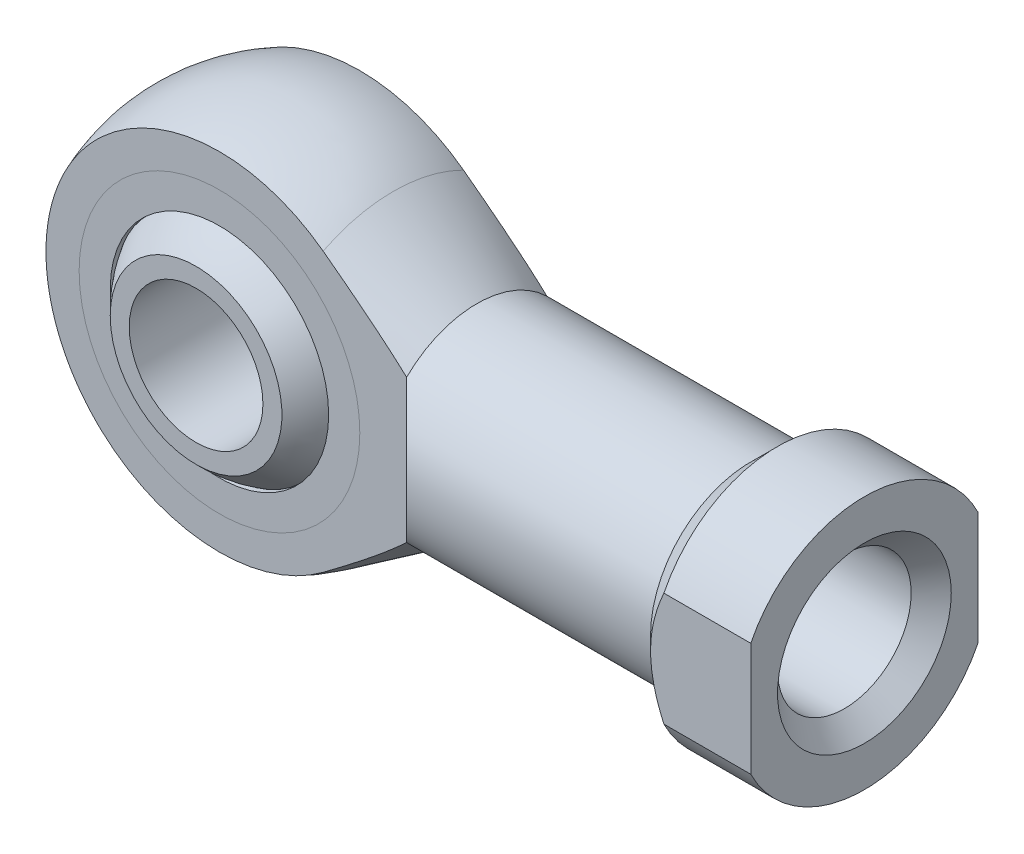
ISO-10303-21;
HEADER;
FILE_DESCRIPTION(('STEP AP214'),'2;1');
FILE_NAME('part.step','',(''),(''),'','','');
FILE_SCHEMA(('AUTOMOTIVE_DESIGN { 1 0 10303 214 1 1 1 1 }'));
ENDSEC;
DATA;
#1=APPLICATION_CONTEXT('core data for automotive mechanical design processes');
#2=APPLICATION_PROTOCOL_DEFINITION('international standard','automotive_design',2000,#1);
#3=PRODUCT_CONTEXT('',#1,'mechanical');
#4=PRODUCT('Part','Part','',(#3));
#5=PRODUCT_RELATED_PRODUCT_CATEGORY('part','',(#4));
#6=PRODUCT_DEFINITION_FORMATION('','',#4);
#7=PRODUCT_DEFINITION_CONTEXT('part definition',#1,'design');
#8=PRODUCT_DEFINITION('design','',#6,#7);
#9=PRODUCT_DEFINITION_SHAPE('','',#8);
#10=(LENGTH_UNIT() NAMED_UNIT(*) SI_UNIT(.MILLI.,.METRE.));
#11=(NAMED_UNIT(*) PLANE_ANGLE_UNIT() SI_UNIT($,.RADIAN.));
#12=(NAMED_UNIT(*) SI_UNIT($,.STERADIAN.) SOLID_ANGLE_UNIT());
#13=UNCERTAINTY_MEASURE_WITH_UNIT(LENGTH_MEASURE(1.E-05),#10,'distance_accuracy_value','');
#14=(GEOMETRIC_REPRESENTATION_CONTEXT(3) GLOBAL_UNCERTAINTY_ASSIGNED_CONTEXT((#13)) GLOBAL_UNIT_ASSIGNED_CONTEXT((#10,
#11,#12)) REPRESENTATION_CONTEXT('',''));
#15=CARTESIAN_POINT('',(0.,0.,0.));
#16=DIRECTION('',(0.,0.,1.));
#17=DIRECTION('',(1.,0.,0.));
#18=AXIS2_PLACEMENT_3D('',#15,#16,#17);
#19=CARTESIAN_POINT('',(0.,0.,0.));
#20=DIRECTION('',(0.,1.,0.));
#21=DIRECTION('',(1.,0.,0.));
#22=AXIS2_PLACEMENT_3D('',#19,#20,#21);
#23=SPHERICAL_SURFACE('',#22,9.5);
#24=CARTESIAN_POINT('',(0.,0.,0.));
#25=DIRECTION('',(0.,0.,-1.));
#26=DIRECTION('',(-1.,0.,0.));
#27=AXIS2_PLACEMENT_3D('',#24,#25,#26);
#28=SPHERICAL_SURFACE('',#27,9.5);
#29=CARTESIAN_POINT('',(0.,0.,7.));
#30=DIRECTION('',(0.,0.,-1.));
#31=DIRECTION('',(-1.,0.,0.));
#32=AXIS2_PLACEMENT_3D('',#29,#30,#31);
#33=CIRCLE('',#32,6.42261628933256);
#34=CARTESIAN_POINT('',(-6.42261628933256,0.,7.));
#35=VERTEX_POINT('',#34);
#36=EDGE_CURVE('P0_E26',#35,#35,#33,.F.);
#37=ORIENTED_EDGE('',*,*,#36,.F.);
#38=EDGE_LOOP('',(#37));
#39=FACE_BOUND('',#38,.T.);
#40=CARTESIAN_POINT('',(0.,0.,-7.));
#41=DIRECTION('',(0.,0.,1.));
#42=DIRECTION('',(1.,0.,0.));
#43=AXIS2_PLACEMENT_3D('',#40,#41,#42);
#44=CIRCLE('',#43,6.42261628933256);
#45=CARTESIAN_POINT('',(6.42261628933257,0.,-7.));
#46=VERTEX_POINT('',#45);
#47=EDGE_CURVE('P0_E10',#46,#46,#44,.F.);
#48=ORIENTED_EDGE('',*,*,#47,.F.);
#49=EDGE_LOOP('',(#48));
#50=FACE_BOUND('',#49,.T.);
#51=ADVANCED_FACE('P0_F14',(#39,#50),#28,.T.);
#52=CARTESIAN_POINT('',(0.,0.,-9.5));
#53=DIRECTION('',(0.,0.,1.));
#54=DIRECTION('',(1.,0.,0.));
#55=AXIS2_PLACEMENT_3D('',#52,#53,#54);
#56=CYLINDRICAL_SURFACE('',#55,5.);
#57=CARTESIAN_POINT('',(0.,0.,7.));
#58=DIRECTION('',(0.,0.,-1.));
#59=DIRECTION('',(-1.,0.,0.));
#60=AXIS2_PLACEMENT_3D('',#57,#58,#59);
#61=CIRCLE('',#60,5.);
#62=CARTESIAN_POINT('',(-5.,0.,7.));
#63=VERTEX_POINT('',#62);
#64=EDGE_CURVE('P0_E17',#63,#63,#61,.F.);
#65=ORIENTED_EDGE('',*,*,#64,.T.);
#66=EDGE_LOOP('',(#65));
#67=FACE_BOUND('',#66,.T.);
#68=CARTESIAN_POINT('',(0.,0.,-7.));
#69=DIRECTION('',(0.,0.,1.));
#70=DIRECTION('',(1.,0.,0.));
#71=AXIS2_PLACEMENT_3D('',#68,#69,#70);
#72=CIRCLE('',#71,5.);
#73=CARTESIAN_POINT('',(5.,0.,-7.));
#74=VERTEX_POINT('',#73);
#75=EDGE_CURVE('P0_E21',#74,#74,#72,.F.);
#76=ORIENTED_EDGE('',*,*,#75,.T.);
#77=EDGE_LOOP('',(#76));
#78=FACE_BOUND('',#77,.T.);
#79=ADVANCED_FACE('P0_F34',(#67,#78),#56,.F.);
#80=CARTESIAN_POINT('',(-9.5,-9.5,-7.));
#81=DIRECTION('',(0.,0.,1.));
#82=DIRECTION('',(1.,0.,0.));
#83=AXIS2_PLACEMENT_3D('',#80,#81,#82);
#84=PLANE('',#83);
#85=ORIENTED_EDGE('',*,*,#47,.T.);
#86=EDGE_LOOP('',(#85));
#87=FACE_BOUND('',#86,.T.);
#88=ORIENTED_EDGE('',*,*,#75,.F.);
#89=EDGE_LOOP('',(#88));
#90=FACE_BOUND('',#89,.T.);
#91=ADVANCED_FACE('P0_F39',(#87,#90),#84,.F.);
#92=CARTESIAN_POINT('',(-9.5,-9.5,7.));
#93=DIRECTION('',(0.,0.,-1.));
#94=DIRECTION('',(-1.,0.,0.));
#95=AXIS2_PLACEMENT_3D('',#92,#93,#94);
#96=PLANE('',#95);
#97=ORIENTED_EDGE('',*,*,#36,.T.);
#98=EDGE_LOOP('',(#97));
#99=FACE_BOUND('',#98,.T.);
#100=ORIENTED_EDGE('',*,*,#64,.F.);
#101=EDGE_LOOP('',(#100));
#102=FACE_BOUND('',#101,.T.);
#103=ADVANCED_FACE('P0_F37',(#99,#102),#96,.F.);
#104=CLOSED_SHELL('',(#51,#79,#91,#103));
#105=MANIFOLD_SOLID_BREP('P0_B1',#104);
#106=CARTESIAN_POINT('',(0.,0.,5.25));
#107=DIRECTION('',(0.,0.,1.));
#108=DIRECTION('',(1.,0.,0.));
#109=AXIS2_PLACEMENT_3D('',#106,#107,#108);
#110=PLANE('',#109);
#111=CARTESIAN_POINT('',(0.,0.,5.25));
#112=DIRECTION('',(0.,0.,1.));
#113=DIRECTION('',(1.,0.,0.));
#114=AXIS2_PLACEMENT_3D('',#111,#112,#113);
#115=CIRCLE('',#114,10.5);
#116=CARTESIAN_POINT('',(10.5,0.,5.25));
#117=VERTEX_POINT('',#116);
#118=EDGE_CURVE('P1_E10',#117,#117,#115,.T.);
#119=ORIENTED_EDGE('',*,*,#118,.T.);
#120=EDGE_LOOP('',(#119));
#121=FACE_BOUND('',#120,.T.);
#122=CARTESIAN_POINT('',(0.,0.,5.25));
#123=DIRECTION('',(0.,0.,1.));
#124=DIRECTION('',(1.,0.,0.));
#125=AXIS2_PLACEMENT_3D('',#122,#123,#124);
#126=CIRCLE('',#125,8.17);
#127=CARTESIAN_POINT('',(8.17,0.,5.25));
#128=VERTEX_POINT('',#127);
#129=EDGE_CURVE('P1_E25',#128,#128,#126,.T.);
#130=ORIENTED_EDGE('',*,*,#129,.F.);
#131=EDGE_LOOP('',(#130));
#132=FACE_BOUND('',#131,.T.);
#133=ADVANCED_FACE('P1_F14',(#121,#132),#110,.T.);
#134=CARTESIAN_POINT('',(0.,0.,4.85));
#135=DIRECTION('',(0.,0.,1.));
#136=DIRECTION('',(1.,0.,0.));
#137=AXIS2_PLACEMENT_3D('',#134,#135,#136);
#138=PLANE('',#137);
#139=CARTESIAN_POINT('',(0.,0.,4.85));
#140=DIRECTION('',(0.,0.,1.));
#141=DIRECTION('',(1.,0.,0.));
#142=AXIS2_PLACEMENT_3D('',#139,#140,#141);
#143=CIRCLE('',#142,10.5);
#144=CARTESIAN_POINT('',(10.5,0.,4.85));
#145=VERTEX_POINT('',#144);
#146=EDGE_CURVE('P1_E18',#145,#145,#143,.T.);
#147=ORIENTED_EDGE('',*,*,#146,.F.);
#148=EDGE_LOOP('',(#147));
#149=FACE_BOUND('',#148,.T.);
#150=CARTESIAN_POINT('',(0.,0.,4.85));
#151=DIRECTION('',(0.,0.,1.));
#152=DIRECTION('',(1.,0.,0.));
#153=AXIS2_PLACEMENT_3D('',#150,#151,#152);
#154=CIRCLE('',#153,8.17);
#155=CARTESIAN_POINT('',(8.17,0.,4.85));
#156=VERTEX_POINT('',#155);
#157=EDGE_CURVE('P1_E27',#156,#156,#154,.T.);
#158=ORIENTED_EDGE('',*,*,#157,.T.);
#159=EDGE_LOOP('',(#158));
#160=FACE_BOUND('',#159,.T.);
#161=ADVANCED_FACE('P1_F37',(#149,#160),#138,.F.);
#162=CARTESIAN_POINT('',(0.,0.,5.25));
#163=DIRECTION('',(0.,0.,-1.));
#164=DIRECTION('',(-1.,0.,0.));
#165=AXIS2_PLACEMENT_3D('',#162,#163,#164);
#166=CYLINDRICAL_SURFACE('',#165,10.5);
#167=ORIENTED_EDGE('',*,*,#118,.F.);
#168=EDGE_LOOP('',(#167));
#169=FACE_BOUND('',#168,.T.);
#170=ORIENTED_EDGE('',*,*,#146,.T.);
#171=EDGE_LOOP('',(#170));
#172=FACE_BOUND('',#171,.T.);
#173=ADVANCED_FACE('P1_F16',(#169,#172),#166,.T.);
#174=CARTESIAN_POINT('',(0.,0.,5.25));
#175=DIRECTION('',(0.,0.,-1.));
#176=DIRECTION('',(-1.,0.,0.));
#177=AXIS2_PLACEMENT_3D('',#174,#175,#176);
#178=CYLINDRICAL_SURFACE('',#177,8.17);
#179=ORIENTED_EDGE('',*,*,#129,.T.);
#180=EDGE_LOOP('',(#179));
#181=FACE_BOUND('',#180,.T.);
#182=ORIENTED_EDGE('',*,*,#157,.F.);
#183=EDGE_LOOP('',(#182));
#184=FACE_BOUND('',#183,.T.);
#185=ADVANCED_FACE('P1_F33',(#181,#184),#178,.F.);
#186=CLOSED_SHELL('',(#133,#161,#173,#185));
#187=MANIFOLD_SOLID_BREP('P1_B1',#186);
#188=CARTESIAN_POINT('',(0.,0.,-4.85));
#189=DIRECTION('',(0.,0.,1.));
#190=DIRECTION('',(1.,0.,0.));
#191=AXIS2_PLACEMENT_3D('',#188,#189,#190);
#192=PLANE('',#191);
#193=CARTESIAN_POINT('',(0.,0.,-4.85));
#194=DIRECTION('',(0.,0.,1.));
#195=DIRECTION('',(1.,0.,0.));
#196=AXIS2_PLACEMENT_3D('',#193,#194,#195);
#197=CIRCLE('',#196,10.5);
#198=CARTESIAN_POINT('',(10.5,0.,-4.85));
#199=VERTEX_POINT('',#198);
#200=EDGE_CURVE('P2_E10',#199,#199,#197,.T.);
#201=ORIENTED_EDGE('',*,*,#200,.T.);
#202=EDGE_LOOP('',(#201));
#203=FACE_BOUND('',#202,.T.);
#204=CARTESIAN_POINT('',(0.,0.,-4.85));
#205=DIRECTION('',(0.,0.,1.));
#206=DIRECTION('',(1.,0.,0.));
#207=AXIS2_PLACEMENT_3D('',#204,#205,#206);
#208=CIRCLE('',#207,8.17);
#209=CARTESIAN_POINT('',(8.17,0.,-4.85));
#210=VERTEX_POINT('',#209);
#211=EDGE_CURVE('P2_E25',#210,#210,#208,.T.);
#212=ORIENTED_EDGE('',*,*,#211,.F.);
#213=EDGE_LOOP('',(#212));
#214=FACE_BOUND('',#213,.T.);
#215=ADVANCED_FACE('P2_F14',(#203,#214),#192,.T.);
#216=CARTESIAN_POINT('',(0.,0.,-5.25));
#217=DIRECTION('',(0.,0.,1.));
#218=DIRECTION('',(1.,0.,0.));
#219=AXIS2_PLACEMENT_3D('',#216,#217,#218);
#220=PLANE('',#219);
#221=CARTESIAN_POINT('',(0.,0.,-5.25));
#222=DIRECTION('',(0.,0.,1.));
#223=DIRECTION('',(1.,0.,0.));
#224=AXIS2_PLACEMENT_3D('',#221,#222,#223);
#225=CIRCLE('',#224,10.5);
#226=CARTESIAN_POINT('',(10.5,0.,-5.25));
#227=VERTEX_POINT('',#226);
#228=EDGE_CURVE('P2_E18',#227,#227,#225,.T.);
#229=ORIENTED_EDGE('',*,*,#228,.F.);
#230=EDGE_LOOP('',(#229));
#231=FACE_BOUND('',#230,.T.);
#232=CARTESIAN_POINT('',(0.,0.,-5.25));
#233=DIRECTION('',(0.,0.,1.));
#234=DIRECTION('',(1.,0.,0.));
#235=AXIS2_PLACEMENT_3D('',#232,#233,#234);
#236=CIRCLE('',#235,8.17);
#237=CARTESIAN_POINT('',(8.17,0.,-5.25));
#238=VERTEX_POINT('',#237);
#239=EDGE_CURVE('P2_E27',#238,#238,#236,.T.);
#240=ORIENTED_EDGE('',*,*,#239,.T.);
#241=EDGE_LOOP('',(#240));
#242=FACE_BOUND('',#241,.T.);
#243=ADVANCED_FACE('P2_F37',(#231,#242),#220,.F.);
#244=CARTESIAN_POINT('',(0.,0.,-4.85));
#245=DIRECTION('',(0.,0.,-1.));
#246=DIRECTION('',(-1.,0.,0.));
#247=AXIS2_PLACEMENT_3D('',#244,#245,#246);
#248=CYLINDRICAL_SURFACE('',#247,10.5);
#249=ORIENTED_EDGE('',*,*,#200,.F.);
#250=EDGE_LOOP('',(#249));
#251=FACE_BOUND('',#250,.T.);
#252=ORIENTED_EDGE('',*,*,#228,.T.);
#253=EDGE_LOOP('',(#252));
#254=FACE_BOUND('',#253,.T.);
#255=ADVANCED_FACE('P2_F16',(#251,#254),#248,.T.);
#256=CARTESIAN_POINT('',(0.,0.,-4.85));
#257=DIRECTION('',(0.,0.,-1.));
#258=DIRECTION('',(-1.,0.,0.));
#259=AXIS2_PLACEMENT_3D('',#256,#257,#258);
#260=CYLINDRICAL_SURFACE('',#259,8.17);
#261=ORIENTED_EDGE('',*,*,#211,.T.);
#262=EDGE_LOOP('',(#261));
#263=FACE_BOUND('',#262,.T.);
#264=ORIENTED_EDGE('',*,*,#239,.F.);
#265=EDGE_LOOP('',(#264));
#266=FACE_BOUND('',#265,.T.);
#267=ADVANCED_FACE('P2_F33',(#263,#266),#260,.F.);
#268=CLOSED_SHELL('',(#215,#243,#255,#267));
#269=MANIFOLD_SOLID_BREP('P2_B1',#268);
#270=CARTESIAN_POINT('',(0.,0.,0.));
#271=DIRECTION('',(0.,1.,0.));
#272=DIRECTION('',(1.,0.,0.));
#273=AXIS2_PLACEMENT_3D('',#270,#271,#272);
#274=SPHERICAL_SURFACE('',#273,9.5);
#275=CARTESIAN_POINT('',(0.,0.,0.));
#276=DIRECTION('',(0.,0.,1.));
#277=DIRECTION('',(1.,0.,0.));
#278=AXIS2_PLACEMENT_3D('',#275,#276,#277);
#279=SPHERICAL_SURFACE('',#278,9.5);
#280=CARTESIAN_POINT('',(0.,0.,4.85));
#281=DIRECTION('',(0.,0.,1.));
#282=DIRECTION('',(1.,0.,0.));
#283=AXIS2_PLACEMENT_3D('',#280,#281,#282);
#284=CIRCLE('',#283,8.16869022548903);
#285=CARTESIAN_POINT('',(8.16869022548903,0.,4.85));
#286=VERTEX_POINT('',#285);
#287=EDGE_CURVE('P3_E73',#286,#286,#284,.F.);
#288=ORIENTED_EDGE('',*,*,#287,.F.);
#289=EDGE_LOOP('',(#288));
#290=FACE_BOUND('',#289,.T.);
#291=CARTESIAN_POINT('',(0.,0.,-4.85));
#292=DIRECTION('',(0.,0.,-1.));
#293=DIRECTION('',(-1.,0.,0.));
#294=AXIS2_PLACEMENT_3D('',#291,#292,#293);
#295=CIRCLE('',#294,8.16869022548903);
#296=CARTESIAN_POINT('',(-8.16869022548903,0.,-4.85));
#297=VERTEX_POINT('',#296);
#298=EDGE_CURVE('P3_E20',#297,#297,#295,.F.);
#299=ORIENTED_EDGE('',*,*,#298,.F.);
#300=EDGE_LOOP('',(#299));
#301=FACE_BOUND('',#300,.T.);
#302=ADVANCED_FACE('P3_F16',(#290,#301),#279,.F.);
#303=CARTESIAN_POINT('',(-14.,-14.,-5.25));
#304=DIRECTION('',(0.,0.,1.));
#305=DIRECTION('',(1.,0.,0.));
#306=AXIS2_PLACEMENT_3D('',#303,#304,#305);
#307=PLANE('',#306);
#308=CARTESIAN_POINT('',(0.,0.,-5.25));
#309=DIRECTION('',(0.,0.,1.));
#310=DIRECTION('',(1.,0.,0.));
#311=AXIS2_PLACEMENT_3D('',#308,#309,#310);
#312=CIRCLE('',#311,12.9783473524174);
#313=CARTESIAN_POINT('',(7.7561942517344,10.4057172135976,-5.25));
#314=VERTEX_POINT('',#313);
#315=CARTESIAN_POINT('',(7.7561942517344,-10.4057172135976,-5.25));
#316=VERTEX_POINT('',#315);
#317=EDGE_CURVE('P3_E11',#314,#316,#312,.T.);
#318=ORIENTED_EDGE('',*,*,#317,.F.);
#319=CARTESIAN_POINT('',(-26.1731525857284,-33.8293244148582,-5.25));
#320=CARTESIAN_POINT('',(-25.2933000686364,-33.2367889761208,-5.25));
#321=CARTESIAN_POINT('',(-24.4136121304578,-32.6440089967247,-5.25));
#322=CARTESIAN_POINT('',(-22.6546328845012,-31.4578535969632,-5.25));
#323=CARTESIAN_POINT('',(-21.7753415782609,-30.8644781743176,-5.25));
#324=CARTESIAN_POINT('',(-20.0159779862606,-29.6761845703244,-5.25));
#325=CARTESIAN_POINT('',(-19.1359063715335,-29.081265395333,-5.25));
#326=CARTESIAN_POINT('',(-17.3763334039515,-27.8905909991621,-5.25));
#327=CARTESIAN_POINT('',(-16.4968320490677,-27.2948357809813,-5.25));
#328=CARTESIAN_POINT('',(-14.716941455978,-26.087678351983,-5.25));
#329=CARTESIAN_POINT('',(-13.8165692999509,-25.4762509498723,-5.25));
#330=CARTESIAN_POINT('',(-12.016717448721,-24.2520840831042,-5.25));
#331=CARTESIAN_POINT('',(-11.1172377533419,-23.6393446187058,-5.25));
#332=CARTESIAN_POINT('',(-9.3206592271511,-22.4130819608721,-5.25));
#333=CARTESIAN_POINT('',(-8.42355882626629,-21.7995610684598,-5.25));
#334=CARTESIAN_POINT('',(-6.63082526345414,-20.5704528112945,-5.25));
#335=CARTESIAN_POINT('',(-5.7351920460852,-19.9548655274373,-5.25));
#336=CARTESIAN_POINT('',(-3.94786846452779,-18.7223929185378,-5.25));
#337=CARTESIAN_POINT('',(-3.05617377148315,-18.1055138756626,-5.25));
#338=CARTESIAN_POINT('',(-1.27517466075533,-16.8680398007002,-5.25));
#339=CARTESIAN_POINT('',(-0.38587060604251,-16.2474442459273,-5.25));
#340=CARTESIAN_POINT('',(1.39312632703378,-14.9985356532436,-5.25));
#341=CARTESIAN_POINT('',(2.28280387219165,-14.3702007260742,-5.25));
#342=CARTESIAN_POINT('',(3.61319973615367,-13.4223939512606,-5.25));
#343=CARTESIAN_POINT('',(4.05586544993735,-13.1056560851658,-5.25));
#344=CARTESIAN_POINT('',(4.93957807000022,-12.4699382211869,-5.25));
#345=CARTESIAN_POINT('',(5.38062499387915,-12.15095824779,-5.25));
#346=CARTESIAN_POINT('',(6.25418906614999,-11.5149523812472,-5.25));
#347=CARTESIAN_POINT('',(6.68673591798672,-11.1979673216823,-5.25));
#348=CARTESIAN_POINT('',(7.54931828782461,-10.5605992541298,-5.25));
#349=CARTESIAN_POINT('',(7.97935382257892,-10.2402162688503,-5.25));
#350=CARTESIAN_POINT('',(8.83700875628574,-9.59443300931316,-5.25));
#351=CARTESIAN_POINT('',(9.26462151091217,-9.26902389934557,-5.25));
#352=CARTESIAN_POINT('',(10.115364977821,-8.61249883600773,-5.25));
#353=CARTESIAN_POINT('',(10.5384963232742,-8.28138370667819,-5.25));
#354=CARTESIAN_POINT('',(11.1667713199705,-7.78025787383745,-5.25));
#355=CARTESIAN_POINT('',(11.3742618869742,-7.61318950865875,-5.25));
#356=CARTESIAN_POINT('',(11.7873923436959,-7.27678210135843,-5.25));
#357=CARTESIAN_POINT('',(11.9930322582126,-7.10744308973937,-5.25));
#358=CARTESIAN_POINT('',(12.4021947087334,-6.76596294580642,-5.25));
#359=CARTESIAN_POINT('',(12.6057158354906,-6.59382012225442,-5.25));
#360=CARTESIAN_POINT('',(13.0099741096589,-6.24629938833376,-5.25));
#361=CARTESIAN_POINT('',(13.2107113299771,-6.07092156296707,-5.25));
#362=CARTESIAN_POINT('',(13.6079956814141,-5.71685427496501,-5.25));
#363=CARTESIAN_POINT('',(13.8045550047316,-5.53817852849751,-5.25));
#364=CARTESIAN_POINT('',(14.1932497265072,-5.17600968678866,-5.25));
#365=CARTESIAN_POINT('',(14.3853845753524,-4.99251599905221,-5.25));
#366=CARTESIAN_POINT('',(14.7635894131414,-4.61977773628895,-5.25));
#367=CARTESIAN_POINT('',(14.9496659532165,-4.43053983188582,-5.25));
#368=CARTESIAN_POINT('',(15.3139080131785,-4.04462781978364,-5.25));
#369=CARTESIAN_POINT('',(15.4920761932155,-3.84795625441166,-5.25));
#370=CARTESIAN_POINT('',(15.7271784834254,-3.57368424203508,-5.25));
#371=CARTESIAN_POINT('',(15.7889194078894,-3.50019306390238,-5.25));
#372=CARTESIAN_POINT('',(15.9107548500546,-3.35183673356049,-5.25));
#373=CARTESIAN_POINT('',(15.9708491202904,-3.27697137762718,-5.25));
#374=CARTESIAN_POINT('',(16.0891754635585,-3.12572344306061,-5.25));
#375=CARTESIAN_POINT('',(16.1474066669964,-3.04934018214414,-5.25));
#376=CARTESIAN_POINT('',(16.2616894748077,-2.894965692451,-5.25));
#377=CARTESIAN_POINT('',(16.3177411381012,-2.81697450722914,-5.25));
#378=CARTESIAN_POINT('',(16.4816538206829,-2.58110326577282,-5.25));
#379=CARTESIAN_POINT('',(16.5858301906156,-2.42062236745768,-5.25));
#380=CARTESIAN_POINT('',(16.7809249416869,-2.09178345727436,-5.25));
#381=CARTESIAN_POINT('',(16.8718520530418,-1.92343072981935,-5.25));
#382=CARTESIAN_POINT('',(17.0016286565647,-1.65043253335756,-5.25));
#383=CARTESIAN_POINT('',(17.0463570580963,-1.54858037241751,-5.25));
#384=CARTESIAN_POINT('',(17.1287343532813,-1.34203969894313,-5.25));
#385=CARTESIAN_POINT('',(17.1663842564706,-1.23735159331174,-5.25));
#386=CARTESIAN_POINT('',(17.2334747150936,-1.02540649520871,-5.25));
#387=CARTESIAN_POINT('',(17.2629190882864,-0.918150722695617,-5.25));
#388=CARTESIAN_POINT('',(17.3125428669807,-0.701522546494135,-5.25));
#389=CARTESIAN_POINT('',(17.3327247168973,-0.592150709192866,-5.25));
#390=CARTESIAN_POINT('',(17.3631273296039,-0.370871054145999,-5.25));
#391=CARTESIAN_POINT('',(17.3732439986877,-0.258948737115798,-5.25));
#392=CARTESIAN_POINT('',(17.382664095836,-0.0346517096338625,-5.25));
#393=CARTESIAN_POINT('',(17.3819682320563,0.0777229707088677,-5.25));
#394=CARTESIAN_POINT('',(17.3697993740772,0.301875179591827,-5.25));
#395=CARTESIAN_POINT('',(17.358326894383,0.413652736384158,-5.25));
#396=CARTESIAN_POINT('',(17.3251542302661,0.635674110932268,-5.25));
#397=CARTESIAN_POINT('',(17.3034523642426,0.745917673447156,-5.25));
#398=CARTESIAN_POINT('',(17.2453182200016,0.986586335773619,-5.25));
#399=CARTESIAN_POINT('',(17.2067745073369,1.11649962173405,-5.25));
#400=CARTESIAN_POINT('',(17.1181173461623,1.37233134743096,-5.25));
#401=CARTESIAN_POINT('',(17.0679971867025,1.49824742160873,-5.25));
#402=CARTESIAN_POINT('',(16.9580397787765,1.74614052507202,-5.25));
#403=CARTESIAN_POINT('',(16.8981756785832,1.86810551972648,-5.25));
#404=CARTESIAN_POINT('',(16.7706213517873,2.10780837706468,-5.25));
#405=CARTESIAN_POINT('',(16.7029321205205,2.22554677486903,-5.25));
#406=CARTESIAN_POINT('',(16.5320133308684,2.50481861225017,-5.25));
#407=CARTESIAN_POINT('',(16.4256292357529,2.66441485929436,-5.25));
#408=CARTESIAN_POINT('',(16.2033862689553,2.97690499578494,-5.25));
#409=CARTESIAN_POINT('',(16.0875222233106,3.12979515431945,-5.25));
#410=CARTESIAN_POINT('',(15.8483812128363,3.43015682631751,-5.25));
#411=CARTESIAN_POINT('',(15.7250890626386,3.57761617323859,-5.25));
#412=CARTESIAN_POINT('',(15.4729858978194,3.86765984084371,-5.25));
#413=CARTESIAN_POINT('',(15.3441759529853,4.01024509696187,-5.25));
#414=CARTESIAN_POINT('',(15.0812215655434,4.29239367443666,-5.25));
#415=CARTESIAN_POINT('',(14.9470444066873,4.43192638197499,-5.25));
#416=CARTESIAN_POINT('',(14.6751598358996,4.70750762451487,-5.25));
#417=CARTESIAN_POINT('',(14.5374522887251,4.84355602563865,-5.25));
#418=CARTESIAN_POINT('',(14.2593659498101,5.11251109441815,-5.25));
#419=CARTESIAN_POINT('',(14.118990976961,5.24542172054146,-5.25));
#420=CARTESIAN_POINT('',(13.8359027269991,5.50871311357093,-5.25));
#421=CARTESIAN_POINT('',(13.6931895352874,5.63909397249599,-5.25));
#422=CARTESIAN_POINT('',(13.3853959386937,5.91605754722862,-5.25));
#423=CARTESIAN_POINT('',(13.2200187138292,6.06231002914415,-5.25));
#424=CARTESIAN_POINT('',(12.8871676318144,6.35241192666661,-5.25));
#425=CARTESIAN_POINT('',(12.7196937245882,6.49626128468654,-5.25));
#426=CARTESIAN_POINT('',(12.2146361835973,6.92476807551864,-5.25));
#427=CARTESIAN_POINT('',(11.8744481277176,7.20635624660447,-5.25));
#428=CARTESIAN_POINT('',(11.1889901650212,7.76352126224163,-5.25));
#429=CARTESIAN_POINT('',(10.8437183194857,8.03909570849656,-5.25));
#430=CARTESIAN_POINT('',(10.1494640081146,8.58553871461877,-5.25));
#431=CARTESIAN_POINT('',(9.80048145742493,8.85640716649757,-5.25));
#432=CARTESIAN_POINT('',(9.09910313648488,9.39488755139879,-5.25));
#433=CARTESIAN_POINT('',(8.74670268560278,9.66249337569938,-5.25));
#434=CARTESIAN_POINT('',(8.03966492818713,10.1947384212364,-5.25));
#435=CARTESIAN_POINT('',(7.68502759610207,10.4593776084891,-5.25));
#436=CARTESIAN_POINT('',(6.97405475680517,10.9861789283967,-5.25));
#437=CARTESIAN_POINT('',(6.61771968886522,11.2483416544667,-5.25));
#438=CARTESIAN_POINT('',(5.90359408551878,11.770678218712,-5.25));
#439=CARTESIAN_POINT('',(5.54580354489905,12.0308520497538,-5.25));
#440=CARTESIAN_POINT('',(4.47400625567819,12.8064699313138,-5.25));
#441=CARTESIAN_POINT('',(3.75823409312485,13.3194741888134,-5.25));
#442=CARTESIAN_POINT('',(2.32332979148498,14.3408416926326,-5.25));
#443=CARTESIAN_POINT('',(1.60419745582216,14.8492046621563,-5.25));
#444=CARTESIAN_POINT('',(0.164159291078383,15.8619757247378,-5.25));
#445=CARTESIAN_POINT('',(-0.556744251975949,16.3663870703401,-5.25));
#446=CARTESIAN_POINT('',(-2.00038804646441,17.3725419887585,-5.25));
#447=CARTESIAN_POINT('',(-2.72312826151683,17.8742856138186,-5.25));
#448=CARTESIAN_POINT('',(-4.63297721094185,19.1961141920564,-5.25));
#449=CARTESIAN_POINT('',(-5.82129262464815,20.01445519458,-5.25));
#450=CARTESIAN_POINT('',(-8.20055828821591,21.647299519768,-5.25));
#451=CARTESIAN_POINT('',(-9.39150854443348,22.4618028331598,-5.25));
#452=CARTESIAN_POINT('',(-11.7753267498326,24.0880323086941,-5.25));
#453=CARTESIAN_POINT('',(-12.9681947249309,24.8997584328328,-5.25));
#454=CARTESIAN_POINT('',(-15.3553449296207,26.5211289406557,-5.25));
#455=CARTESIAN_POINT('',(-16.5496271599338,27.3307733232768,-5.25));
#456=CARTESIAN_POINT('',(-18.9397953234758,28.9488192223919,-5.25));
#457=CARTESIAN_POINT('',(-20.135681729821,29.757220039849,-5.25));
#458=CARTESIAN_POINT('',(-22.5283020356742,31.3727666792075,-5.25));
#459=CARTESIAN_POINT('',(-23.7250359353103,32.1799125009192,-5.25));
#460=CARTESIAN_POINT('',(-27.3162246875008,34.5998518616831,-5.25));
#461=CARTESIAN_POINT('',(-29.711681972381,36.2111576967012,-5.25));
#462=CARTESIAN_POINT('',(-34.5104462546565,39.4352298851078,-5.25));
#463=CARTESIAN_POINT('',(-36.9137577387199,41.0479895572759,-5.25));
#464=CARTESIAN_POINT('',(-41.7216327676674,44.2716521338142,-5.25));
#465=CARTESIAN_POINT('',(-44.1261963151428,45.8825550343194,-5.25));
#466=CARTESIAN_POINT('',(-48.935064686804,49.1022379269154,-5.25));
#467=CARTESIAN_POINT('',(-51.3393690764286,50.7110185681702,-5.25));
#468=CARTESIAN_POINT('',(-56.1486612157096,53.9275457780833,-5.25));
#469=CARTESIAN_POINT('',(-58.5536489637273,55.5352923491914,-5.25));
#470=CARTESIAN_POINT('',(-60.9588756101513,57.1426811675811,-5.25));
#471=B_SPLINE_CURVE_WITH_KNOTS('',3,(#319,#320,#321,#322,#323,#324,#325,#326,#327,#328,#329,
#330,#331,#332,#333,#334,#335,#336,#337,#338,#339,#340,#341,#342,#343,#344,#345,#346,#347,#348,
#349,#350,#351,#352,#353,#354,#355,#356,#357,#358,#359,#360,#361,#362,#363,#364,#365,#366,#367,
#368,#369,#370,#371,#372,#373,#374,#375,#376,#377,#378,#379,#380,#381,#382,#383,#384,#385,#386,
#387,#388,#389,#390,#391,#392,#393,#394,#395,#396,#397,#398,#399,#400,#401,#402,#403,#404,#405,
#406,#407,#408,#409,#410,#411,#412,#413,#414,#415,#416,#417,#418,#419,#420,#421,#422,#423,#424,
#425,#426,#427,#428,#429,#430,#431,#432,#433,#434,#435,#436,#437,#438,#439,#440,#441,#442,#443,
#444,#445,#446,#447,#448,#449,#450,#451,#452,#453,#454,#455,#456,#457,#458,#459,#460,#461,#462,
#463,#464,#465,#466,#467,#468,#469,#470),.UNSPECIFIED.,.F.,.F.,(4,2,2,2,2,2,2,2,2,2,2,2,2,2,2,2,
2,2,2,2,2,2,2,2,2,2,2,2,2,2,2,2,2,2,2,2,2,2,2,2,2,2,2,2,2,2,2,2,2,2,2,2,2,2,2,2,2,2,2,2,2,2,2,2,
2,2,2,2,2,2,2,2,2,2,2,4),(0.,3.18231815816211,6.36464854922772,9.55151084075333,12.738361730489,
16.0034215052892,19.2684806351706,22.5289649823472,25.7893231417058,29.0421507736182,
32.2954471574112,35.5629822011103,37.1959136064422,38.8288272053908,40.4375988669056,
42.0463597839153,43.6583738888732,45.2701571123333,46.0693176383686,46.8684674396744,
47.6681185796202,48.4677487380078,49.2645842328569,50.0615181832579,50.8575596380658,
51.6533312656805,51.9412638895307,52.2292395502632,52.5173477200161,52.805448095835,
53.3789608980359,53.9520940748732,54.2856004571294,54.6190592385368,54.9523626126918,
55.2855779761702,55.6222046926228,55.9588093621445,56.2953979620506,56.6320419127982,
57.0379131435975,57.4440202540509,57.85126604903,58.2584601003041,58.8333826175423,
59.4086210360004,59.9850781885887,60.5614240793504,61.1420846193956,61.7227674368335,
62.3026736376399,62.8825587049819,63.5448402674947,64.2071376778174,65.5318586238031,
66.8570985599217,68.1823688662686,69.5098252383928,70.8372968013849,72.1644417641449,
73.49159148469,76.1334408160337,78.7754466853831,81.4149830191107,84.054467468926,
88.3829628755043,92.7114687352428,97.0400335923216,101.36860065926,105.699062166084,
110.029524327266,118.690392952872,127.373254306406,136.056133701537,144.734825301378,
153.413496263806),.UNSPECIFIED.);
#472=CARTESIAN_POINT('',(14.,5.35607132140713,-5.25));
#473=VERTEX_POINT('',#472);
#474=EDGE_CURVE('P3_E102',#473,#314,#471,.T.);
#475=ORIENTED_EDGE('',*,*,#474,.F.);
#476=DIRECTION('',(0.,1.,0.));
#477=VECTOR('',#476,1.);
#478=CARTESIAN_POINT('',(14.,-14.,-5.25));
#479=LINE('',#478,#477);
#480=CARTESIAN_POINT('',(14.,-5.35607132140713,-5.25));
#481=VERTEX_POINT('',#480);
#482=EDGE_CURVE('P3_E64',#481,#473,#479,.T.);
#483=ORIENTED_EDGE('',*,*,#482,.F.);
#484=EDGE_CURVE('P3_E33',#316,#481,#471,.T.);
#485=ORIENTED_EDGE('',*,*,#484,.F.);
#486=EDGE_LOOP('',(#318,#475,#483,#485));
#487=FACE_BOUND('',#486,.T.);
#488=CARTESIAN_POINT('',(0.,0.,-5.25));
#489=DIRECTION('',(0.,0.,1.));
#490=DIRECTION('',(1.,0.,0.));
#491=AXIS2_PLACEMENT_3D('',#488,#489,#490);
#492=CIRCLE('',#491,10.5);
#493=CARTESIAN_POINT('',(10.5,0.,-5.25));
#494=VERTEX_POINT('',#493);
#495=EDGE_CURVE('P3_E95',#494,#494,#492,.T.);
#496=ORIENTED_EDGE('',*,*,#495,.T.);
#497=EDGE_LOOP('',(#496));
#498=FACE_BOUND('',#497,.T.);
#499=ADVANCED_FACE('P3_F125',(#487,#498),#307,.F.);
#500=CARTESIAN_POINT('',(14.,0.,0.));
#501=DIRECTION('',(-1.,0.,0.));
#502=DIRECTION('',(0.,0.,1.));
#503=AXIS2_PLACEMENT_3D('',#500,#501,#502);
#504=CONICAL_SURFACE('',#503,7.5,0.5871779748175);
#505=CARTESIAN_POINT('',(7.7561942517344,0.,0.));
#506=DIRECTION('',(-1.,0.,0.));
#507=DIRECTION('',(0.,0.,1.));
#508=AXIS2_PLACEMENT_3D('',#505,#506,#507);
#509=CIRCLE('',#508,11.6551040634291);
#510=CARTESIAN_POINT('',(7.7561942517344,-10.4057172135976,5.25));
#511=VERTEX_POINT('',#510);
#512=EDGE_CURVE('P3_E79',#316,#511,#509,.T.);
#513=ORIENTED_EDGE('',*,*,#512,.F.);
#514=ORIENTED_EDGE('',*,*,#484,.T.);
#515=CARTESIAN_POINT('',(14.,0.,0.));
#516=DIRECTION('',(-1.,0.,0.));
#517=DIRECTION('',(0.,0.,1.));
#518=AXIS2_PLACEMENT_3D('',#515,#516,#517);
#519=CIRCLE('',#518,7.5);
#520=CARTESIAN_POINT('',(14.,-5.35607132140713,5.25));
#521=VERTEX_POINT('',#520);
#522=EDGE_CURVE('P3_E70',#481,#521,#519,.T.);
#523=ORIENTED_EDGE('',*,*,#522,.T.);
#524=CARTESIAN_POINT('',(-25.9816265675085,-33.7003368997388,5.25));
#525=CARTESIAN_POINT('',(-25.1053778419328,-33.1101751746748,5.25));
#526=CARTESIAN_POINT('',(-24.2292942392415,-32.5197681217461,5.25));
#527=CARTESIAN_POINT('',(-22.4775249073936,-31.3383566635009,5.25));
#528=CARTESIAN_POINT('',(-21.6018391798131,-30.7473522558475,5.25));
#529=CARTESIAN_POINT('',(-19.8496674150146,-29.5637843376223,5.25));
#530=CARTESIAN_POINT('',(-18.9731820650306,-28.9712198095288,5.25));
#531=CARTESIAN_POINT('',(-17.220783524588,-27.785252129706,5.25));
#532=CARTESIAN_POINT('',(-16.3448703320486,-27.1918489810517,5.25));
#533=CARTESIAN_POINT('',(-14.5716215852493,-25.98902648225,5.25));
#534=CARTESIAN_POINT('',(-13.6743036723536,-25.3795811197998,5.25));
#535=CARTESIAN_POINT('',(-11.880564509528,-24.1593723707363,5.25));
#536=CARTESIAN_POINT('',(-10.9841432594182,-23.5486089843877,5.25));
#537=CARTESIAN_POINT('',(-9.19370952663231,-22.326306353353,5.25));
#538=CARTESIAN_POINT('',(-8.29969543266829,-21.7147694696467,5.25));
#539=CARTESIAN_POINT('',(-6.51314221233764,-20.4896198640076,5.25));
#540=CARTESIAN_POINT('',(-5.6206030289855,-19.8760072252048,5.25));
#541=CARTESIAN_POINT('',(-3.83951132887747,-18.6474947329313,5.25));
#542=CARTESIAN_POINT('',(-2.95095437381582,-18.0326013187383,5.25));
#543=CARTESIAN_POINT('',(-1.17624146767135,-16.7990789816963,5.25));
#544=CARTESIAN_POINT('',(-0.29008588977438,-16.1804495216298,5.25));
#545=CARTESIAN_POINT('',(1.48266488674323,-14.9353973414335,5.25));
#546=CARTESIAN_POINT('',(2.36924433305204,-14.3089521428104,5.25));
#547=CARTESIAN_POINT('',(3.69496476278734,-13.3639526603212,5.25));
#548=CARTESIAN_POINT('',(4.13606510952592,-13.0481476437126,5.25));
#549=CARTESIAN_POINT('',(5.01663658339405,-12.4142826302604,5.25));
#550=CARTESIAN_POINT('',(5.45610772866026,-12.0962226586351,5.25));
#551=CARTESIAN_POINT('',(6.32630973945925,-11.4621872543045,5.25));
#552=CARTESIAN_POINT('',(6.75707151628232,-11.1462542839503,5.25));
#553=CARTESIAN_POINT('',(7.61606881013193,-10.5109732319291,5.25));
#554=CARTESIAN_POINT('',(8.04430434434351,-10.1916251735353,5.25));
#555=CARTESIAN_POINT('',(8.89835474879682,-9.54787636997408,5.25));
#556=CARTESIAN_POINT('',(9.32416278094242,-9.22346654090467,5.25));
#557=CARTESIAN_POINT('',(10.17126594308,-8.56890953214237,5.25));
#558=CARTESIAN_POINT('',(10.5925617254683,-8.2387632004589,5.25));
#559=CARTESIAN_POINT('',(11.2180199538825,-7.73908326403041,5.25));
#560=CARTESIAN_POINT('',(11.4245466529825,-7.57250898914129,5.25));
#561=CARTESIAN_POINT('',(11.8357360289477,-7.23707753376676,5.25));
#562=CARTESIAN_POINT('',(12.0403987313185,-7.0682203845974,5.25));
#563=CARTESIAN_POINT('',(12.4475922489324,-6.72768700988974,5.25));
#564=CARTESIAN_POINT('',(12.6501216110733,-6.55600904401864,5.25));
#565=CARTESIAN_POINT('',(13.0523742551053,-6.20940003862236,5.25));
#566=CARTESIAN_POINT('',(13.2520976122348,-6.03446908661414,5.25));
#567=CARTESIAN_POINT('',(13.6473130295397,-5.68128584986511,5.25));
#568=CARTESIAN_POINT('',(13.8428176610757,-5.5030476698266,5.25));
#569=CARTESIAN_POINT('',(14.2293650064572,-5.14172720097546,5.25));
#570=CARTESIAN_POINT('',(14.4204071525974,-4.9586443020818,5.25));
#571=CARTESIAN_POINT('',(14.796369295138,-4.58670007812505,5.25));
#572=CARTESIAN_POINT('',(14.9812960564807,-4.39784561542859,5.25));
#573=CARTESIAN_POINT('',(15.3431620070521,-4.01266367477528,5.25));
#574=CARTESIAN_POINT('',(15.5201039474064,-3.81633881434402,5.25));
#575=CARTESIAN_POINT('',(15.7528832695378,-3.54318896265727,5.25));
#576=CARTESIAN_POINT('',(15.8135896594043,-3.47050187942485,5.25));
#577=CARTESIAN_POINT('',(15.9333720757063,-3.32377487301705,5.25));
#578=CARTESIAN_POINT('',(15.9924478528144,-3.24973474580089,5.25));
#579=CARTESIAN_POINT('',(16.1087568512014,-3.1001633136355,5.25));
#580=CARTESIAN_POINT('',(16.1659892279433,-3.02463135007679,5.25));
#581=CARTESIAN_POINT('',(16.2783012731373,-2.87198904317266,5.25));
#582=CARTESIAN_POINT('',(16.3333810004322,-2.79487874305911,5.25));
#583=CARTESIAN_POINT('',(16.4944485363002,-2.56167841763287,5.25));
#584=CARTESIAN_POINT('',(16.596801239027,-2.40303823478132,5.25));
#585=CARTESIAN_POINT('',(16.7884750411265,-2.07805936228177,5.25));
#586=CARTESIAN_POINT('',(16.8778043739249,-1.91172562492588,5.25));
#587=CARTESIAN_POINT('',(17.0059487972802,-1.64082694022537,5.25));
#588=CARTESIAN_POINT('',(17.050443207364,-1.53894751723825,5.25));
#589=CARTESIAN_POINT('',(17.1323270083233,-1.33236002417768,5.25));
#590=CARTESIAN_POINT('',(17.1697174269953,-1.22765236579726,5.25));
#591=CARTESIAN_POINT('',(17.2362651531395,-1.01568192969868,5.25));
#592=CARTESIAN_POINT('',(17.2654262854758,-0.908420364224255,5.25));
#593=CARTESIAN_POINT('',(17.3144656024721,-0.691801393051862,5.25));
#594=CARTESIAN_POINT('',(17.3343462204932,-0.582444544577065,5.25));
#595=CARTESIAN_POINT('',(17.3641337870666,-0.361236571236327,5.25));
#596=CARTESIAN_POINT('',(17.3739379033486,-0.249371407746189,5.25));
#597=CARTESIAN_POINT('',(17.3827428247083,-0.0252186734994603,5.25));
#598=CARTESIAN_POINT('',(17.3817443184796,0.0870688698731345,5.25));
#599=CARTESIAN_POINT('',(17.3689949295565,0.31102146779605,5.25));
#600=CARTESIAN_POINT('',(17.3572443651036,0.422686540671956,5.25));
#601=CARTESIAN_POINT('',(17.3235512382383,0.644462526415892,5.25));
#602=CARTESIAN_POINT('',(17.3016069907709,0.754573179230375,5.25));
#603=CARTESIAN_POINT('',(17.242855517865,0.995460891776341,5.25));
#604=CARTESIAN_POINT('',(17.2038922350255,1.12571031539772,5.25));
#605=CARTESIAN_POINT('',(17.1143712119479,1.38217678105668,5.25));
#606=CARTESIAN_POINT('',(17.0638066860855,1.50839141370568,5.25));
#607=CARTESIAN_POINT('',(16.952949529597,1.75685591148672,5.25));
#608=CARTESIAN_POINT('',(16.8926298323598,1.87909357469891,5.25));
#609=CARTESIAN_POINT('',(16.7641645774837,2.11932039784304,5.25));
#610=CARTESIAN_POINT('',(16.6960200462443,2.2373101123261,5.25));
#611=CARTESIAN_POINT('',(16.5235168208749,2.51797206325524,5.25));
#612=CARTESIAN_POINT('',(16.4159439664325,2.67866212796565,5.25));
#613=CARTESIAN_POINT('',(16.191257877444,2.99326511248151,5.25));
#614=CARTESIAN_POINT('',(16.0741393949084,3.14717423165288,5.25));
#615=CARTESIAN_POINT('',(15.8324476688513,3.44952428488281,5.25));
#616=CARTESIAN_POINT('',(15.7078590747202,3.59795287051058,5.25));
#617=CARTESIAN_POINT('',(15.45314147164,3.88989670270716,5.25));
#618=CARTESIAN_POINT('',(15.3230135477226,4.03341290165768,5.25));
#619=CARTESIAN_POINT('',(15.0574021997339,4.31740172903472,5.25));
#620=CARTESIAN_POINT('',(14.9218860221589,4.45784359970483,5.25));
#621=CARTESIAN_POINT('',(14.6473158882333,4.73522429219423,5.25));
#622=CARTESIAN_POINT('',(14.5082617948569,4.87216297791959,5.25));
#623=CARTESIAN_POINT('',(14.2274812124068,5.1428828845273,5.25));
#624=CARTESIAN_POINT('',(14.0857585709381,5.27666810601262,5.25));
#625=CARTESIAN_POINT('',(13.7999730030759,5.54169914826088,5.25));
#626=CARTESIAN_POINT('',(13.6559101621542,5.67294506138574,5.25));
#627=CARTESIAN_POINT('',(13.3449124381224,5.95203467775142,5.25));
#628=CARTESIAN_POINT('',(13.1776758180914,6.09954176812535,5.25));
#629=CARTESIAN_POINT('',(12.8410989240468,6.39213863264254,5.25));
#630=CARTESIAN_POINT('',(12.6717586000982,6.53722834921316,5.25));
#631=CARTESIAN_POINT('',(12.1610949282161,6.96944073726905,5.25));
#632=CARTESIAN_POINT('',(11.8171603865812,7.25347864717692,5.25));
#633=CARTESIAN_POINT('',(11.1242021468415,7.81552103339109,5.25));
#634=CARTESIAN_POINT('',(10.7751765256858,8.09352312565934,5.25));
#635=CARTESIAN_POINT('',(10.0734125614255,8.6448096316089,5.25));
#636=CARTESIAN_POINT('',(9.72067413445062,8.91809393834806,5.25));
#637=CARTESIAN_POINT('',(9.01178199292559,9.46140144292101,5.25));
#638=CARTESIAN_POINT('',(8.655623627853,9.73141856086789,5.25));
#639=CARTESIAN_POINT('',(7.94107179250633,10.2684839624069,5.25));
#640=CARTESIAN_POINT('',(7.58267829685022,10.5355322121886,5.25));
#641=CARTESIAN_POINT('',(6.86419535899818,11.0671516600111,5.25));
#642=CARTESIAN_POINT('',(6.50410635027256,11.3317234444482,5.25));
#643=CARTESIAN_POINT('',(5.78247592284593,11.8588787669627,5.25));
#644=CARTESIAN_POINT('',(5.42093450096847,12.1214623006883,5.25));
#645=CARTESIAN_POINT('',(4.33796996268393,12.9042558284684,5.25));
#646=CARTESIAN_POINT('',(3.61478563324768,13.4220290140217,5.25));
#647=CARTESIAN_POINT('',(2.16506688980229,14.4529440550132,5.25));
#648=CARTESIAN_POINT('',(1.4385322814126,14.9660856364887,5.25));
#649=CARTESIAN_POINT('',(-0.0163015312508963,15.988423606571,5.25));
#650=CARTESIAN_POINT('',(-0.744598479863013,16.4976232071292,5.25));
#651=CARTESIAN_POINT('',(-2.20302165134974,17.5133634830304,5.25));
#652=CARTESIAN_POINT('',(-2.93314783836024,18.01990420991,5.25));
#653=CARTESIAN_POINT('',(-4.85043505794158,19.3460702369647,5.25));
#654=CARTESIAN_POINT('',(-6.03875940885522,20.1640132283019,5.25));
#655=CARTESIAN_POINT('',(-8.41798728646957,21.7961409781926,5.25));
#656=CARTESIAN_POINT('',(-9.60889081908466,22.6103257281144,5.25));
#657=CARTESIAN_POINT('',(-11.9925790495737,24.2359698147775,5.25));
#658=CARTESIAN_POINT('',(-13.1853637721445,25.0474291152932,5.25));
#659=CARTESIAN_POINT('',(-15.5723232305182,26.6683011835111,5.25));
#660=CARTESIAN_POINT('',(-16.7664979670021,27.47771395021,5.25));
#661=CARTESIAN_POINT('',(-19.1564272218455,29.0953165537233,5.25));
#662=CARTESIAN_POINT('',(-20.3521821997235,29.9035057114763,5.25));
#663=CARTESIAN_POINT('',(-22.7445274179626,31.5186469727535,5.25));
#664=CARTESIAN_POINT('',(-23.9411176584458,32.3255990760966,5.25));
#665=CARTESIAN_POINT('',(-27.5318626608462,34.7449772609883,5.25));
#666=CARTESIAN_POINT('',(-29.9270065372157,36.3559352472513,5.25));
#667=CARTESIAN_POINT('',(-34.7258482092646,39.5798282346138,5.25));
#668=CARTESIAN_POINT('',(-37.129550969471,41.1927558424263,5.25));
#669=CARTESIAN_POINT('',(-41.9381961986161,44.416772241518,5.25));
#670=CARTESIAN_POINT('',(-44.3431386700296,46.0278610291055,5.25));
#671=CARTESIAN_POINT('',(-49.1527739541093,49.2479388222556,5.25));
#672=CARTESIAN_POINT('',(-51.557466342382,50.8569284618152,5.25));
#673=CARTESIAN_POINT('',(-56.3675291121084,54.0738820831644,5.25));
#674=CARTESIAN_POINT('',(-58.7728994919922,55.6818460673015,5.25));
#675=CARTESIAN_POINT('',(-61.1785071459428,57.2894547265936,5.25));
#676=B_SPLINE_CURVE_WITH_KNOTS('',3,(#524,#525,#526,#527,#528,#529,#530,#531,#532,#533,#534,
#535,#536,#537,#538,#539,#540,#541,#542,#543,#544,#545,#546,#547,#548,#549,#550,#551,#552,#553,
#554,#555,#556,#557,#558,#559,#560,#561,#562,#563,#564,#565,#566,#567,#568,#569,#570,#571,#572,
#573,#574,#575,#576,#577,#578,#579,#580,#581,#582,#583,#584,#585,#586,#587,#588,#589,#590,#591,
#592,#593,#594,#595,#596,#597,#598,#599,#600,#601,#602,#603,#604,#605,#606,#607,#608,#609,#610,
#611,#612,#613,#614,#615,#616,#617,#618,#619,#620,#621,#622,#623,#624,#625,#626,#627,#628,#629,
#630,#631,#632,#633,#634,#635,#636,#637,#638,#639,#640,#641,#642,#643,#644,#645,#646,#647,#648,
#649,#650,#651,#652,#653,#654,#655,#656,#657,#658,#659,#660,#661,#662,#663,#664,#665,#666,#667,
#668,#669,#670,#671,#672,#673,#674,#675),.UNSPECIFIED.,.F.,.F.,(4,2,2,2,2,2,2,2,2,2,2,2,2,2,2,2,
2,2,2,2,2,2,2,2,2,2,2,2,2,2,2,2,2,2,2,2,2,2,2,2,2,2,2,2,2,2,2,2,2,2,2,2,2,2,2,2,2,2,2,2,2,2,2,2,
2,2,2,2,2,2,2,2,2,2,2,4),(0.,3.16937293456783,6.3387583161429,9.51275122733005,12.6867325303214,
15.9408716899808,19.1950101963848,22.4444919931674,25.6938451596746,28.9355423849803,
32.1777174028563,35.4343898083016,37.0618735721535,38.6893391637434,40.2919255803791,
41.8945010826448,43.5003910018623,45.106045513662,45.9020242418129,46.697992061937,
47.4944709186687,48.2909283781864,49.0845393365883,49.8782507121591,50.6710525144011,
51.4635790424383,51.7476697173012,52.0318035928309,52.3160658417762,52.6003203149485,
53.1662332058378,53.7317867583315,54.0650847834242,54.3983345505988,54.7314291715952,
55.0644364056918,55.4008092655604,55.7371606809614,56.0735021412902,56.4098992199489,
56.8170932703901,57.224526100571,57.6331094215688,58.0416392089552,58.6212657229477,
59.2012130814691,59.7823960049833,60.3634656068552,60.9488773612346,61.5343118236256,
62.118958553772,62.7035839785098,63.3725380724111,64.0415080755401,65.3795744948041,
66.7181601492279,68.0567761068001,69.3975863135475,70.7384117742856,72.0789112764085,
73.4194137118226,76.0876719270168,78.7560869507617,81.4220321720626,84.0879255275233,
88.4157664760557,92.7436173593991,97.0715255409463,101.39943584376,105.729215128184,
110.058995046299,118.718501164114,127.402617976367,136.086752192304,144.766759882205,
153.446747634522),.UNSPECIFIED.);
#677=EDGE_CURVE('P3_E56',#521,#511,#676,.F.);
#678=ORIENTED_EDGE('',*,*,#677,.T.);
#679=EDGE_LOOP('',(#513,#514,#523,#678));
#680=FACE_BOUND('',#679,.T.);
#681=ADVANCED_FACE('P3_F75',(#680),#504,.T.);
#682=CARTESIAN_POINT('',(14.,0.,0.));
#683=DIRECTION('',(-1.,0.,0.));
#684=DIRECTION('',(0.,0.,1.));
#685=AXIS2_PLACEMENT_3D('',#682,#683,#684);
#686=PLANE('',#685);
#687=ORIENTED_EDGE('',*,*,#522,.F.);
#688=ORIENTED_EDGE('',*,*,#482,.T.);
#689=CARTESIAN_POINT('',(14.,5.35607132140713,5.25));
#690=VERTEX_POINT('',#689);
#691=EDGE_CURVE('P3_E72',#690,#473,#519,.T.);
#692=ORIENTED_EDGE('',*,*,#691,.F.);
#693=DIRECTION('',(0.,1.,0.));
#694=VECTOR('',#693,1.);
#695=CARTESIAN_POINT('',(14.,-14.,5.25));
#696=LINE('',#695,#694);
#697=EDGE_CURVE('P3_E59',#521,#690,#696,.T.);
#698=ORIENTED_EDGE('',*,*,#697,.F.);
#699=EDGE_LOOP('',(#687,#688,#692,#698));
#700=FACE_BOUND('',#699,.T.);
#701=ADVANCED_FACE('P3_F18',(#700),#686,.F.);
#702=ORIENTED_EDGE('',*,*,#691,.T.);
#703=ORIENTED_EDGE('',*,*,#474,.T.);
#704=CARTESIAN_POINT('',(7.7561942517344,10.4057172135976,5.25));
#705=VERTEX_POINT('',#704);
#706=EDGE_CURVE('P3_E76',#705,#314,#509,.T.);
#707=ORIENTED_EDGE('',*,*,#706,.F.);
#708=EDGE_CURVE('P3_E40',#705,#690,#676,.F.);
#709=ORIENTED_EDGE('',*,*,#708,.T.);
#710=EDGE_LOOP('',(#702,#703,#707,#709));
#711=FACE_BOUND('',#710,.T.);
#712=ADVANCED_FACE('P3_F109',(#711),#504,.T.);
#713=CARTESIAN_POINT('',(0.,0.,0.));
#714=DIRECTION('',(-1.,0.,0.));
#715=DIRECTION('',(0.,1.,0.));
#716=AXIS2_PLACEMENT_3D('',#713,#714,#715);
#717=SPHERICAL_SURFACE('',#716,14.);
#718=ORIENTED_EDGE('',*,*,#706,.T.);
#719=ORIENTED_EDGE('',*,*,#317,.T.);
#720=ORIENTED_EDGE('',*,*,#512,.T.);
#721=CARTESIAN_POINT('',(0.,0.,5.25));
#722=DIRECTION('',(0.,0.,-1.));
#723=DIRECTION('',(-1.,0.,0.));
#724=AXIS2_PLACEMENT_3D('',#721,#722,#723);
#725=CIRCLE('',#724,12.9783473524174);
#726=EDGE_CURVE('P3_E25',#511,#705,#725,.T.);
#727=ORIENTED_EDGE('',*,*,#726,.T.);
#728=EDGE_LOOP('',(#718,#719,#720,#727));
#729=FACE_BOUND('',#728,.T.);
#730=ADVANCED_FACE('P3_F112',(#729),#717,.T.);
#731=CARTESIAN_POINT('',(-14.,-14.,5.25));
#732=DIRECTION('',(0.,0.,-1.));
#733=DIRECTION('',(-1.,0.,0.));
#734=AXIS2_PLACEMENT_3D('',#731,#732,#733);
#735=PLANE('',#734);
#736=CARTESIAN_POINT('',(0.,0.,5.25));
#737=DIRECTION('',(0.,0.,1.));
#738=DIRECTION('',(1.,0.,0.));
#739=AXIS2_PLACEMENT_3D('',#736,#737,#738);
#740=CIRCLE('',#739,10.5);
#741=CARTESIAN_POINT('',(10.5,0.,5.25));
#742=VERTEX_POINT('',#741);
#743=EDGE_CURVE('P3_E88',#742,#742,#740,.T.);
#744=ORIENTED_EDGE('',*,*,#743,.F.);
#745=EDGE_LOOP('',(#744));
#746=FACE_BOUND('',#745,.T.);
#747=ORIENTED_EDGE('',*,*,#726,.F.);
#748=ORIENTED_EDGE('',*,*,#677,.F.);
#749=ORIENTED_EDGE('',*,*,#697,.T.);
#750=ORIENTED_EDGE('',*,*,#708,.F.);
#751=EDGE_LOOP('',(#747,#748,#749,#750));
#752=FACE_BOUND('',#751,.T.);
#753=ADVANCED_FACE('P3_F58',(#746,#752),#735,.F.);
#754=CARTESIAN_POINT('',(0.,0.,4.85));
#755=DIRECTION('',(0.,0.,1.));
#756=DIRECTION('',(1.,0.,0.));
#757=AXIS2_PLACEMENT_3D('',#754,#755,#756);
#758=PLANE('',#757);
#759=CARTESIAN_POINT('',(0.,0.,4.85));
#760=DIRECTION('',(0.,0.,1.));
#761=DIRECTION('',(1.,0.,0.));
#762=AXIS2_PLACEMENT_3D('',#759,#760,#761);
#763=CIRCLE('',#762,10.5);
#764=CARTESIAN_POINT('',(10.5,0.,4.85));
#765=VERTEX_POINT('',#764);
#766=EDGE_CURVE('P3_E84',#765,#765,#763,.T.);
#767=ORIENTED_EDGE('',*,*,#766,.T.);
#768=EDGE_LOOP('',(#767));
#769=FACE_BOUND('',#768,.T.);
#770=ORIENTED_EDGE('',*,*,#287,.T.);
#771=EDGE_LOOP('',(#770));
#772=FACE_BOUND('',#771,.T.);
#773=ADVANCED_FACE('P3_F122',(#769,#772),#758,.T.);
#774=CARTESIAN_POINT('',(0.,0.,4.85));
#775=DIRECTION('',(0.,0.,1.));
#776=DIRECTION('',(1.,0.,0.));
#777=AXIS2_PLACEMENT_3D('',#774,#775,#776);
#778=CYLINDRICAL_SURFACE('',#777,10.5);
#779=ORIENTED_EDGE('',*,*,#766,.F.);
#780=EDGE_LOOP('',(#779));
#781=FACE_BOUND('',#780,.T.);
#782=ORIENTED_EDGE('',*,*,#743,.T.);
#783=EDGE_LOOP('',(#782));
#784=FACE_BOUND('',#783,.T.);
#785=ADVANCED_FACE('P3_F134',(#781,#784),#778,.F.);
#786=CARTESIAN_POINT('',(0.,0.,-4.85));
#787=DIRECTION('',(0.,0.,-1.));
#788=DIRECTION('',(1.,0.,0.));
#789=AXIS2_PLACEMENT_3D('',#786,#787,#788);
#790=PLANE('',#789);
#791=CARTESIAN_POINT('',(0.,0.,-4.85));
#792=DIRECTION('',(0.,0.,1.));
#793=DIRECTION('',(1.,0.,0.));
#794=AXIS2_PLACEMENT_3D('',#791,#792,#793);
#795=CIRCLE('',#794,10.5);
#796=CARTESIAN_POINT('',(10.5,0.,-4.85));
#797=VERTEX_POINT('',#796);
#798=EDGE_CURVE('P3_E154',#797,#797,#795,.T.);
#799=ORIENTED_EDGE('',*,*,#798,.F.);
#800=EDGE_LOOP('',(#799));
#801=FACE_BOUND('',#800,.T.);
#802=ORIENTED_EDGE('',*,*,#298,.T.);
#803=EDGE_LOOP('',(#802));
#804=FACE_BOUND('',#803,.T.);
#805=ADVANCED_FACE('P3_F138',(#801,#804),#790,.T.);
#806=CARTESIAN_POINT('',(0.,0.,-4.85));
#807=DIRECTION('',(0.,0.,-1.));
#808=DIRECTION('',(-1.,0.,0.));
#809=AXIS2_PLACEMENT_3D('',#806,#807,#808);
#810=CYLINDRICAL_SURFACE('',#809,10.5);
#811=ORIENTED_EDGE('',*,*,#798,.T.);
#812=EDGE_LOOP('',(#811));
#813=FACE_BOUND('',#812,.T.);
#814=ORIENTED_EDGE('',*,*,#495,.F.);
#815=EDGE_LOOP('',(#814));
#816=FACE_BOUND('',#815,.T.);
#817=ADVANCED_FACE('P3_F142',(#813,#816),#810,.F.);
#818=CLOSED_SHELL('',(#302,#499,#681,#701,#712,#730,#753,#773,#785,#805,#817));
#819=MANIFOLD_SOLID_BREP('P3_B1',#818);
#820=CARTESIAN_POINT('',(14.,0.,0.));
#821=DIRECTION('',(-1.,0.,0.));
#822=DIRECTION('',(0.,0.,1.));
#823=AXIS2_PLACEMENT_3D('',#820,#821,#822);
#824=CYLINDRICAL_SURFACE('',#823,9.50000000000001);
#825=CARTESIAN_POINT('',(43.,0.,0.));
#826=DIRECTION('',(-1.,0.,0.));
#827=DIRECTION('',(0.,0.,1.));
#828=AXIS2_PLACEMENT_3D('',#825,#826,#827);
#829=CIRCLE('',#828,9.50000000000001);
#830=CARTESIAN_POINT('',(43.,4.2426406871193,8.5));
#831=VERTEX_POINT('',#830);
#832=CARTESIAN_POINT('',(43.,4.2426406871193,-8.5));
#833=VERTEX_POINT('',#832);
#834=EDGE_CURVE('P4_E86',#831,#833,#829,.T.);
#835=ORIENTED_EDGE('',*,*,#834,.T.);
#836=DIRECTION('',(-1.,0.,0.));
#837=VECTOR('',#836,1.);
#838=CARTESIAN_POINT('',(14.,4.2426406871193,-8.5));
#839=LINE('',#838,#837);
#840=CARTESIAN_POINT('',(36.5,4.2426406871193,-8.5));
#841=VERTEX_POINT('',#840);
#842=EDGE_CURVE('P4_E70',#833,#841,#839,.T.);
#843=ORIENTED_EDGE('',*,*,#842,.T.);
#844=CARTESIAN_POINT('',(36.5,0.,0.));
#845=DIRECTION('',(-1.,0.,0.));
#846=DIRECTION('',(0.,0.,1.));
#847=AXIS2_PLACEMENT_3D('',#844,#845,#846);
#848=CIRCLE('',#847,9.50000000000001);
#849=CARTESIAN_POINT('',(36.5,4.2426406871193,8.5));
#850=VERTEX_POINT('',#849);
#851=EDGE_CURVE('P4_E94',#850,#841,#848,.T.);
#852=ORIENTED_EDGE('',*,*,#851,.F.);
#853=DIRECTION('',(-1.,0.,0.));
#854=VECTOR('',#853,1.);
#855=CARTESIAN_POINT('',(14.,4.2426406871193,8.5));
#856=LINE('',#855,#854);
#857=EDGE_CURVE('P4_E38',#850,#831,#856,.F.);
#858=ORIENTED_EDGE('',*,*,#857,.T.);
#859=EDGE_LOOP('',(#835,#843,#852,#858));
#860=FACE_BOUND('',#859,.T.);
#861=ADVANCED_FACE('P4_F15',(#860),#824,.T.);
#862=CARTESIAN_POINT('',(43.,0.,0.));
#863=DIRECTION('',(1.,0.,0.));
#864=DIRECTION('',(0.,0.,-1.));
#865=AXIS2_PLACEMENT_3D('',#862,#863,#864);
#866=PLANE('',#865);
#867=CARTESIAN_POINT('',(43.,0.,0.));
#868=DIRECTION('',(1.,0.,0.));
#869=DIRECTION('',(0.,0.,-1.));
#870=AXIS2_PLACEMENT_3D('',#867,#868,#869);
#871=CIRCLE('',#870,6.5);
#872=CARTESIAN_POINT('',(43.,0.,-6.49999999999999));
#873=VERTEX_POINT('',#872);
#874=EDGE_CURVE('P4_E10',#873,#873,#871,.F.);
#875=ORIENTED_EDGE('',*,*,#874,.T.);
#876=EDGE_LOOP('',(#875));
#877=FACE_BOUND('',#876,.T.);
#878=DIRECTION('',(0.,-1.,0.));
#879=VECTOR('',#878,1.);
#880=CARTESIAN_POINT('',(43.,-9.5,-8.5));
#881=LINE('',#880,#879);
#882=CARTESIAN_POINT('',(43.,-4.2426406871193,-8.5));
#883=VERTEX_POINT('',#882);
#884=EDGE_CURVE('P4_E73',#833,#883,#881,.T.);
#885=ORIENTED_EDGE('',*,*,#884,.F.);
#886=ORIENTED_EDGE('',*,*,#834,.F.);
#887=DIRECTION('',(0.,1.,0.));
#888=VECTOR('',#887,1.);
#889=CARTESIAN_POINT('',(43.,-9.5,8.5));
#890=LINE('',#889,#888);
#891=CARTESIAN_POINT('',(43.,-4.2426406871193,8.5));
#892=VERTEX_POINT('',#891);
#893=EDGE_CURVE('P4_E79',#892,#831,#890,.T.);
#894=ORIENTED_EDGE('',*,*,#893,.F.);
#895=EDGE_CURVE('P4_E87',#883,#892,#829,.T.);
#896=ORIENTED_EDGE('',*,*,#895,.F.);
#897=EDGE_LOOP('',(#885,#886,#894,#896));
#898=FACE_BOUND('',#897,.T.);
#899=ADVANCED_FACE('P4_F84',(#877,#898),#866,.T.);
#900=CARTESIAN_POINT('',(23.,0.,0.));
#901=DIRECTION('',(1.,0.,0.));
#902=DIRECTION('',(0.,0.,-1.));
#903=AXIS2_PLACEMENT_3D('',#900,#901,#902);
#904=PLANE('',#903);
#905=CARTESIAN_POINT('',(23.,0.,0.));
#906=DIRECTION('',(1.,0.,0.));
#907=DIRECTION('',(0.,0.,-1.));
#908=AXIS2_PLACEMENT_3D('',#905,#906,#907);
#909=CIRCLE('',#908,5.);
#910=CARTESIAN_POINT('',(23.,0.,-5.));
#911=VERTEX_POINT('',#910);
#912=EDGE_CURVE('P4_E92',#911,#911,#909,.T.);
#913=ORIENTED_EDGE('',*,*,#912,.T.);
#914=EDGE_LOOP('',(#913));
#915=FACE_BOUND('',#914,.T.);
#916=CARTESIAN_POINT('',(23.,0.,0.));
#917=DIRECTION('',(1.,0.,0.));
#918=DIRECTION('',(0.,0.,-1.));
#919=AXIS2_PLACEMENT_3D('',#916,#917,#918);
#920=CIRCLE('',#919,4.25);
#921=CARTESIAN_POINT('',(23.,0.,-4.25));
#922=VERTEX_POINT('',#921);
#923=EDGE_CURVE('P4_E100',#922,#922,#920,.F.);
#924=ORIENTED_EDGE('',*,*,#923,.T.);
#925=EDGE_LOOP('',(#924));
#926=FACE_BOUND('',#925,.T.);
#927=ADVANCED_FACE('P4_F149',(#915,#926),#904,.T.);
#928=CARTESIAN_POINT('',(23.,0.,0.));
#929=DIRECTION('',(1.,0.,0.));
#930=DIRECTION('',(0.,0.,-1.));
#931=AXIS2_PLACEMENT_3D('',#928,#929,#930);
#932=CYLINDRICAL_SURFACE('',#931,5.);
#933=CARTESIAN_POINT('',(41.5,0.,0.));
#934=DIRECTION('',(1.,0.,0.));
#935=DIRECTION('',(0.,0.,-1.));
#936=AXIS2_PLACEMENT_3D('',#933,#934,#935);
#937=CIRCLE('',#936,5.);
#938=CARTESIAN_POINT('',(41.5,0.,-5.));
#939=VERTEX_POINT('',#938);
#940=EDGE_CURVE('P4_E23',#939,#939,#937,.T.);
#941=ORIENTED_EDGE('',*,*,#940,.T.);
#942=EDGE_LOOP('',(#941));
#943=FACE_BOUND('',#942,.T.);
#944=ORIENTED_EDGE('',*,*,#912,.F.);
#945=EDGE_LOOP('',(#944));
#946=FACE_BOUND('',#945,.T.);
#947=ADVANCED_FACE('P4_F182',(#943,#946),#932,.F.);
#948=CARTESIAN_POINT('',(20.5,0.,0.));
#949=DIRECTION('',(1.,0.,0.));
#950=DIRECTION('',(0.,0.,-1.));
#951=AXIS2_PLACEMENT_3D('',#948,#949,#950);
#952=CYLINDRICAL_SURFACE('',#951,4.25);
#953=CARTESIAN_POINT('',(20.5,0.,0.));
#954=DIRECTION('',(-1.,0.,0.));
#955=DIRECTION('',(0.,-1.,0.));
#956=AXIS2_PLACEMENT_3D('',#953,#954,#955);
#957=CIRCLE('',#956,4.25);
#958=CARTESIAN_POINT('',(20.5,0.,-4.25));
#959=VERTEX_POINT('',#958);
#960=EDGE_CURVE('P4_E89',#959,#959,#957,.T.);
#961=CARTESIAN_POINT('',(20.5,0.,-4.25));
#962=CARTESIAN_POINT('',(20.5260416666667,0.,-4.25));
#963=CARTESIAN_POINT('',(20.5520833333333,0.,-4.25));
#964=CARTESIAN_POINT('',(20.6041666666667,0.,-4.25));
#965=CARTESIAN_POINT('',(20.6302083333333,0.,-4.25));
#966=CARTESIAN_POINT('',(20.6822916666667,0.,-4.25));
#967=CARTESIAN_POINT('',(20.7083333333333,0.,-4.25));
#968=CARTESIAN_POINT('',(20.7604166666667,0.,-4.25));
#969=CARTESIAN_POINT('',(20.7864583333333,0.,-4.25));
#970=CARTESIAN_POINT('',(20.8385416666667,0.,-4.25));
#971=CARTESIAN_POINT('',(20.8645833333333,0.,-4.25));
#972=CARTESIAN_POINT('',(20.9166666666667,0.,-4.25));
#973=CARTESIAN_POINT('',(20.9427083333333,0.,-4.25));
#974=CARTESIAN_POINT('',(20.9947916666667,0.,-4.25));
#975=CARTESIAN_POINT('',(21.0208333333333,0.,-4.25));
#976=CARTESIAN_POINT('',(21.0729166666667,0.,-4.25));
#977=CARTESIAN_POINT('',(21.0989583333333,0.,-4.25));
#978=CARTESIAN_POINT('',(21.1510416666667,0.,-4.25));
#979=CARTESIAN_POINT('',(21.1770833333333,0.,-4.25));
#980=CARTESIAN_POINT('',(21.2291666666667,0.,-4.25));
#981=CARTESIAN_POINT('',(21.2552083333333,0.,-4.25));
#982=CARTESIAN_POINT('',(21.3072916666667,0.,-4.25));
#983=CARTESIAN_POINT('',(21.3333333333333,0.,-4.25));
#984=CARTESIAN_POINT('',(21.3854166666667,0.,-4.25));
#985=CARTESIAN_POINT('',(21.4114583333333,0.,-4.25));
#986=CARTESIAN_POINT('',(21.4635416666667,0.,-4.25));
#987=CARTESIAN_POINT('',(21.4895833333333,0.,-4.25));
#988=CARTESIAN_POINT('',(21.5416666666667,0.,-4.25));
#989=CARTESIAN_POINT('',(21.5677083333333,0.,-4.25));
#990=CARTESIAN_POINT('',(21.6197916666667,0.,-4.25));
#991=CARTESIAN_POINT('',(21.6458333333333,0.,-4.25));
#992=CARTESIAN_POINT('',(21.6979166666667,0.,-4.25));
#993=CARTESIAN_POINT('',(21.7239583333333,0.,-4.25));
#994=CARTESIAN_POINT('',(21.7760416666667,0.,-4.25));
#995=CARTESIAN_POINT('',(21.8020833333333,0.,-4.25));
#996=CARTESIAN_POINT('',(21.8541666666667,0.,-4.25));
#997=CARTESIAN_POINT('',(21.8802083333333,0.,-4.25));
#998=CARTESIAN_POINT('',(21.9322916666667,0.,-4.25));
#999=CARTESIAN_POINT('',(21.9583333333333,0.,-4.25));
#1000=CARTESIAN_POINT('',(22.0104166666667,0.,-4.25));
#1001=CARTESIAN_POINT('',(22.0364583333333,0.,-4.25));
#1002=CARTESIAN_POINT('',(22.0885416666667,0.,-4.25));
#1003=CARTESIAN_POINT('',(22.1145833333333,0.,-4.25));
#1004=CARTESIAN_POINT('',(22.1666666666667,0.,-4.25));
#1005=CARTESIAN_POINT('',(22.1927083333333,0.,-4.25));
#1006=CARTESIAN_POINT('',(22.2447916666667,0.,-4.25));
#1007=CARTESIAN_POINT('',(22.2708333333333,0.,-4.25));
#1008=CARTESIAN_POINT('',(22.3229166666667,0.,-4.25));
#1009=CARTESIAN_POINT('',(22.3489583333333,0.,-4.25));
#1010=CARTESIAN_POINT('',(22.4010416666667,0.,-4.25));
#1011=CARTESIAN_POINT('',(22.4270833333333,0.,-4.25));
#1012=CARTESIAN_POINT('',(22.4791666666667,0.,-4.25));
#1013=CARTESIAN_POINT('',(22.5052083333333,0.,-4.25));
#1014=CARTESIAN_POINT('',(22.5572916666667,0.,-4.25));
#1015=CARTESIAN_POINT('',(22.5833333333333,0.,-4.25));
#1016=CARTESIAN_POINT('',(22.6354166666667,0.,-4.25));
#1017=CARTESIAN_POINT('',(22.6614583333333,0.,-4.25));
#1018=CARTESIAN_POINT('',(22.7135416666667,0.,-4.25));
#1019=CARTESIAN_POINT('',(22.7395833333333,0.,-4.25));
#1020=CARTESIAN_POINT('',(22.7916666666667,0.,-4.25));
#1021=CARTESIAN_POINT('',(22.8177083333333,0.,-4.25));
#1022=CARTESIAN_POINT('',(22.8697916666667,0.,-4.25));
#1023=CARTESIAN_POINT('',(22.8958333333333,0.,-4.25));
#1024=CARTESIAN_POINT('',(22.9479166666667,0.,-4.25));
#1025=CARTESIAN_POINT('',(22.9739583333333,0.,-4.25));
#1026=CARTESIAN_POINT('',(23.,0.,-4.25));
#1027=B_SPLINE_CURVE_WITH_KNOTS('',3,(#961,#962,#963,#964,#965,#966,#967,#968,#969,#970,#971,
#972,#973,#974,#975,#976,#977,#978,#979,#980,#981,#982,#983,#984,#985,#986,#987,#988,#989,#990,
#991,#992,#993,#994,#995,#996,#997,#998,#999,#1000,#1001,#1002,#1003,#1004,#1005,#1006,#1007,
#1008,#1009,#1010,#1011,#1012,#1013,#1014,#1015,#1016,#1017,#1018,#1019,#1020,#1021,#1022,#1023,
#1024,#1025,#1026),.UNSPECIFIED.,.F.,.F.,(4,2,2,2,2,2,2,2,2,2,2,2,2,2,2,2,2,2,2,2,2,2,2,2,2,2,2,
2,2,2,2,2,4),(0.,0.0781250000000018,0.15625,0.234375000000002,0.3125,0.390625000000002,0.46875,
0.546875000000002,0.625000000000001,0.703124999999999,0.781250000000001,0.859374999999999,
0.937500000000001,1.015625,1.09375,1.171875,1.25,1.328125,1.40625,1.484375,1.5625,1.640625,
1.71875,1.796875,1.875,1.953125,2.03125,2.109375,2.1875,2.265625,2.34375,2.421875,2.5),.UNSPECIFIED.);
#1028=EDGE_CURVE('P4_BSEAM163',#959,#922,#1027,.T.);
#1029=ORIENTED_EDGE('',*,*,#960,.T.);
#1030=ORIENTED_EDGE('',*,*,#923,.F.);
#1031=ORIENTED_EDGE('',*,*,#1028,.T.);
#1032=ORIENTED_EDGE('',*,*,#1028,.F.);
#1033=EDGE_LOOP('',(#1029,#1031,#1030,#1032));
#1034=FACE_BOUND('',#1033,.T.);
#1035=ADVANCED_FACE('P4_F163',(#1034),#952,.F.);
#1036=CARTESIAN_POINT('',(20.5,0.,0.));
#1037=DIRECTION('',(1.,0.,0.));
#1038=DIRECTION('',(0.,1.,0.));
#1039=AXIS2_PLACEMENT_3D('',#1036,#1037,#1038);
#1040=CONICAL_SURFACE('',#1039,4.25,1.0471975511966);
#1041=CARTESIAN_POINT('',(18.0462613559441,0.,0.));
#1042=VERTEX_POINT('',#1041);
#1043=VERTEX_LOOP('',#1042);
#1044=FACE_BOUND('',#1043,.T.);
#1045=ORIENTED_EDGE('',*,*,#960,.F.);
#1046=EDGE_LOOP('',(#1045));
#1047=FACE_BOUND('',#1046,.T.);
#1048=ADVANCED_FACE('P4_F154',(#1044,#1047),#1040,.F.);
#1049=CARTESIAN_POINT('',(36.5,-4.2426406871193,-8.5));
#1050=VERTEX_POINT('',#1049);
#1051=CARTESIAN_POINT('',(36.5,-4.2426406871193,8.5));
#1052=VERTEX_POINT('',#1051);
#1053=EDGE_CURVE('P4_E167',#1050,#1052,#848,.T.);
#1054=ORIENTED_EDGE('',*,*,#1053,.F.);
#1055=DIRECTION('',(-1.,0.,0.));
#1056=VECTOR('',#1055,1.);
#1057=CARTESIAN_POINT('',(14.,-4.2426406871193,-8.5));
#1058=LINE('',#1057,#1056);
#1059=EDGE_CURVE('P4_E30',#1050,#883,#1058,.F.);
#1060=ORIENTED_EDGE('',*,*,#1059,.T.);
#1061=ORIENTED_EDGE('',*,*,#895,.T.);
#1062=DIRECTION('',(-1.,0.,0.));
#1063=VECTOR('',#1062,1.);
#1064=CARTESIAN_POINT('',(14.,-4.2426406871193,8.5));
#1065=LINE('',#1064,#1063);
#1066=EDGE_CURVE('P4_E169',#892,#1052,#1065,.T.);
#1067=ORIENTED_EDGE('',*,*,#1066,.T.);
#1068=EDGE_LOOP('',(#1054,#1060,#1061,#1067));
#1069=FACE_BOUND('',#1068,.T.);
#1070=ADVANCED_FACE('P4_F144',(#1069),#824,.T.);
#1071=CARTESIAN_POINT('',(36.5,0.,0.));
#1072=DIRECTION('',(1.,0.,0.));
#1073=DIRECTION('',(0.,0.,-1.));
#1074=AXIS2_PLACEMENT_3D('',#1071,#1072,#1073);
#1075=CONICAL_SURFACE('',#1074,9.50000000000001,0.785398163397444);
#1076=CARTESIAN_POINT('',(34.5,0.,0.));
#1077=DIRECTION('',(-1.,0.,0.));
#1078=DIRECTION('',(0.,0.,1.));
#1079=AXIS2_PLACEMENT_3D('',#1076,#1077,#1078);
#1080=CIRCLE('',#1079,7.5);
#1081=CARTESIAN_POINT('',(34.5,0.,7.5));
#1082=VERTEX_POINT('',#1081);
#1083=EDGE_CURVE('P4_E171',#1082,#1082,#1080,.T.);
#1084=ORIENTED_EDGE('',*,*,#1083,.F.);
#1085=EDGE_LOOP('',(#1084));
#1086=FACE_BOUND('',#1085,.T.);
#1087=ORIENTED_EDGE('',*,*,#851,.T.);
#1088=CARTESIAN_POINT('',(39.747494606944,-9.49992730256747,-8.5));
#1089=CARTESIAN_POINT('',(39.5741511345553,-9.267272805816,-8.5));
#1090=CARTESIAN_POINT('',(39.4025685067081,-9.03328416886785,-8.5));
#1091=CARTESIAN_POINT('',(39.0637026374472,-8.56212500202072,-8.5));
#1092=CARTESIAN_POINT('',(38.8964205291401,-8.32495365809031,-8.5));
#1093=CARTESIAN_POINT('',(38.5657473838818,-7.8451831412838,-8.5));
#1094=CARTESIAN_POINT('',(38.4023965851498,-7.60255613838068,-8.5));
#1095=CARTESIAN_POINT('',(38.0820785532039,-7.11313692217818,-8.5));
#1096=CARTESIAN_POINT('',(37.9251108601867,-6.86634501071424,-8.5));
#1097=CARTESIAN_POINT('',(37.6108033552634,-6.35468795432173,-8.5));
#1098=CARTESIAN_POINT('',(37.4538888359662,-6.08956021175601,-8.5));
#1099=CARTESIAN_POINT('',(37.1507882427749,-5.55315070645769,-8.5));
#1100=CARTESIAN_POINT('',(37.0046037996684,-5.28186801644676,-8.5));
#1101=CARTESIAN_POINT('',(36.7261427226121,-4.7332385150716,-8.5));
#1102=CARTESIAN_POINT('',(36.5938252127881,-4.45591261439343,-8.5));
#1103=CARTESIAN_POINT('',(36.3460573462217,-3.89388686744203,-8.5));
#1104=CARTESIAN_POINT('',(36.230599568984,-3.60919033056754,-8.5));
#1105=CARTESIAN_POINT('',(36.0277218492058,-3.05163838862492,-8.5));
#1106=CARTESIAN_POINT('',(35.9389327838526,-2.77928648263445,-8.5));
#1107=CARTESIAN_POINT('',(35.7832480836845,-2.22827727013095,-8.5));
#1108=CARTESIAN_POINT('',(35.7163540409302,-1.94961950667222,-8.5));
#1109=CARTESIAN_POINT('',(35.6089881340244,-1.39216245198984,-8.5));
#1110=CARTESIAN_POINT('',(35.5680806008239,-1.1134484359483,-8.5));
#1111=CARTESIAN_POINT('',(35.5134368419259,-0.553356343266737,-8.5));
#1112=CARTESIAN_POINT('',(35.4996964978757,-0.271978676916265,-8.5));
#1113=CARTESIAN_POINT('',(35.5003040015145,0.281758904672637,-8.5));
#1114=CARTESIAN_POINT('',(35.5137699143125,0.554120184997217,-8.5));
#1115=CARTESIAN_POINT('',(35.5661629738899,1.09636685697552,-8.5));
#1116=CARTESIAN_POINT('',(35.6050926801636,1.36625199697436,-8.5));
#1117=CARTESIAN_POINT('',(35.7070015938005,1.90615240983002,-8.5));
#1118=CARTESIAN_POINT('',(35.7703804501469,2.17609107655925,-8.5));
#1119=CARTESIAN_POINT('',(35.9178939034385,2.71011907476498,-8.5));
#1120=CARTESIAN_POINT('',(36.0020264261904,2.97420898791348,-8.5));
#1121=CARTESIAN_POINT('',(36.1987603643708,3.52729072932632,-8.5));
#1122=CARTESIAN_POINT('',(36.3135610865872,3.81549295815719,-8.5));
#1123=CARTESIAN_POINT('',(36.5606910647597,4.38434815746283,-8.5));
#1124=CARTESIAN_POINT('',(36.6930286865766,4.66499744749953,-8.5));
#1125=CARTESIAN_POINT('',(36.9720739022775,5.22015608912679,-8.5));
#1126=CARTESIAN_POINT('',(37.1188272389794,5.4946422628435,-8.5));
#1127=CARTESIAN_POINT('',(37.423449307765,6.03727543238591,-8.5));
#1128=CARTESIAN_POINT('',(37.5813162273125,6.30542345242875,-8.5));
#1129=CARTESIAN_POINT('',(37.8978227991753,6.82292474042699,-8.5));
#1130=CARTESIAN_POINT('',(38.0560264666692,7.0725460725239,-8.5));
#1131=CARTESIAN_POINT('',(38.3790164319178,7.56750686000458,-8.5));
#1132=CARTESIAN_POINT('',(38.5438032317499,7.81284598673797,-8.5));
#1133=CARTESIAN_POINT('',(38.87740392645,8.29780098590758,-8.5));
#1134=CARTESIAN_POINT('',(39.0461737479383,8.5374472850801,-8.5));
#1135=CARTESIAN_POINT('',(39.3881241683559,9.01347619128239,-8.5));
#1136=CARTESIAN_POINT('',(39.5613035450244,9.24985967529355,-8.5));
#1137=CARTESIAN_POINT('',(39.7362839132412,9.48487890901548,-8.5));
#1138=B_SPLINE_CURVE_WITH_KNOTS('',3,(#1088,#1089,#1090,#1091,#1092,#1093,#1094,#1095,#1096,
#1097,#1098,#1099,#1100,#1101,#1102,#1103,#1104,#1105,#1106,#1107,#1108,#1109,#1110,#1111,#1112,
#1113,#1114,#1115,#1116,#1117,#1118,#1119,#1120,#1121,#1122,#1123,#1124,#1125,#1126,#1127,#1128,
#1129,#1130,#1131,#1132,#1133,#1134,#1135,#1136,#1137),.UNSPECIFIED.,.F.,.F.,(4,2,2,2,2,2,2,2,2,
2,2,2,2,2,2,2,2,2,2,2,2,2,2,2,4),(0.,0.870411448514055,1.74104993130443,2.61844056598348,
3.49576788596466,4.41981375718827,5.343999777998,6.26538002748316,7.18635351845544,
8.04496686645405,8.90364263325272,9.74751366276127,10.5912567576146,11.4080874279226,
12.225000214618,13.0558745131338,13.8866658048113,14.8166084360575,15.7469962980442,
16.6804381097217,17.6137280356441,18.5002026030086,19.3867449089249,20.2660213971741,
21.1450567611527),.UNSPECIFIED.);
#1139=EDGE_CURVE('P4_E74',#841,#1050,#1138,.F.);
#1140=ORIENTED_EDGE('',*,*,#1139,.T.);
#1141=ORIENTED_EDGE('',*,*,#1053,.T.);
#1142=CARTESIAN_POINT('',(39.747494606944,-9.49992730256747,8.5));
#1143=CARTESIAN_POINT('',(39.5741511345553,-9.267272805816,8.5));
#1144=CARTESIAN_POINT('',(39.4025685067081,-9.03328416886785,8.5));
#1145=CARTESIAN_POINT('',(39.0637026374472,-8.56212500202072,8.5));
#1146=CARTESIAN_POINT('',(38.8964205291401,-8.32495365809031,8.5));
#1147=CARTESIAN_POINT('',(38.5657473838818,-7.8451831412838,8.5));
#1148=CARTESIAN_POINT('',(38.4023965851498,-7.60255613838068,8.5));
#1149=CARTESIAN_POINT('',(38.0820785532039,-7.11313692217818,8.5));
#1150=CARTESIAN_POINT('',(37.9251108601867,-6.86634501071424,8.5));
#1151=CARTESIAN_POINT('',(37.6108033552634,-6.35468795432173,8.5));
#1152=CARTESIAN_POINT('',(37.4538888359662,-6.08956021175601,8.5));
#1153=CARTESIAN_POINT('',(37.1507882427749,-5.55315070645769,8.5));
#1154=CARTESIAN_POINT('',(37.0046037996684,-5.28186801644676,8.5));
#1155=CARTESIAN_POINT('',(36.7261427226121,-4.7332385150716,8.5));
#1156=CARTESIAN_POINT('',(36.5938252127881,-4.45591261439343,8.5));
#1157=CARTESIAN_POINT('',(36.3460573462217,-3.89388686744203,8.5));
#1158=CARTESIAN_POINT('',(36.230599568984,-3.60919033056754,8.5));
#1159=CARTESIAN_POINT('',(36.0277218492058,-3.05163838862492,8.5));
#1160=CARTESIAN_POINT('',(35.9389327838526,-2.77928648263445,8.5));
#1161=CARTESIAN_POINT('',(35.7832480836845,-2.22827727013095,8.5));
#1162=CARTESIAN_POINT('',(35.7163540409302,-1.94961950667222,8.5));
#1163=CARTESIAN_POINT('',(35.6089881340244,-1.39216245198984,8.5));
#1164=CARTESIAN_POINT('',(35.5680806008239,-1.1134484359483,8.5));
#1165=CARTESIAN_POINT('',(35.5134368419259,-0.553356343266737,8.5));
#1166=CARTESIAN_POINT('',(35.4996964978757,-0.271978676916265,8.5));
#1167=CARTESIAN_POINT('',(35.5003040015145,0.281758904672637,8.5));
#1168=CARTESIAN_POINT('',(35.5137699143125,0.554120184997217,8.5));
#1169=CARTESIAN_POINT('',(35.5661629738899,1.09636685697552,8.5));
#1170=CARTESIAN_POINT('',(35.6050926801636,1.36625199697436,8.5));
#1171=CARTESIAN_POINT('',(35.7070015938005,1.90615240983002,8.5));
#1172=CARTESIAN_POINT('',(35.7703804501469,2.17609107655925,8.5));
#1173=CARTESIAN_POINT('',(35.9178939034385,2.71011907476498,8.5));
#1174=CARTESIAN_POINT('',(36.0020264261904,2.97420898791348,8.5));
#1175=CARTESIAN_POINT('',(36.1987603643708,3.52729072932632,8.5));
#1176=CARTESIAN_POINT('',(36.3135610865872,3.81549295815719,8.5));
#1177=CARTESIAN_POINT('',(36.5606910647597,4.38434815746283,8.5));
#1178=CARTESIAN_POINT('',(36.6930286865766,4.66499744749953,8.5));
#1179=CARTESIAN_POINT('',(36.9720739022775,5.22015608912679,8.5));
#1180=CARTESIAN_POINT('',(37.1188272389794,5.4946422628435,8.5));
#1181=CARTESIAN_POINT('',(37.423449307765,6.03727543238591,8.5));
#1182=CARTESIAN_POINT('',(37.5813162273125,6.30542345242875,8.5));
#1183=CARTESIAN_POINT('',(37.8978227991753,6.82292474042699,8.5));
#1184=CARTESIAN_POINT('',(38.0560264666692,7.0725460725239,8.5));
#1185=CARTESIAN_POINT('',(38.3790164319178,7.56750686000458,8.5));
#1186=CARTESIAN_POINT('',(38.5438032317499,7.81284598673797,8.5));
#1187=CARTESIAN_POINT('',(38.87740392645,8.29780098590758,8.5));
#1188=CARTESIAN_POINT('',(39.0461737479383,8.5374472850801,8.5));
#1189=CARTESIAN_POINT('',(39.3881241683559,9.01347619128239,8.5));
#1190=CARTESIAN_POINT('',(39.5613035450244,9.24985967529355,8.5));
#1191=CARTESIAN_POINT('',(39.7362839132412,9.48487890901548,8.5));
#1192=B_SPLINE_CURVE_WITH_KNOTS('',3,(#1142,#1143,#1144,#1145,#1146,#1147,#1148,#1149,#1150,
#1151,#1152,#1153,#1154,#1155,#1156,#1157,#1158,#1159,#1160,#1161,#1162,#1163,#1164,#1165,#1166,
#1167,#1168,#1169,#1170,#1171,#1172,#1173,#1174,#1175,#1176,#1177,#1178,#1179,#1180,#1181,#1182,
#1183,#1184,#1185,#1186,#1187,#1188,#1189,#1190,#1191),.UNSPECIFIED.,.F.,.F.,(4,2,2,2,2,2,2,2,2,
2,2,2,2,2,2,2,2,2,2,2,2,2,2,2,4),(0.,0.870411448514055,1.74104993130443,2.61844056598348,
3.49576788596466,4.41981375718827,5.343999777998,6.26538002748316,7.18635351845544,
8.04496686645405,8.90364263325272,9.74751366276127,10.5912567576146,11.4080874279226,
12.225000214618,13.0558745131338,13.8866658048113,14.8166084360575,15.7469962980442,
16.6804381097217,17.6137280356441,18.5002026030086,19.3867449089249,20.2660213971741,
21.1450567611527),.UNSPECIFIED.);
#1193=EDGE_CURVE('P4_E115',#1052,#850,#1192,.T.);
#1194=ORIENTED_EDGE('',*,*,#1193,.T.);
#1195=EDGE_LOOP('',(#1087,#1140,#1141,#1194));
#1196=FACE_BOUND('',#1195,.T.);
#1197=ADVANCED_FACE('P4_F128',(#1086,#1196),#1075,.T.);
#1198=CARTESIAN_POINT('',(14.,-14.,5.25));
#1199=DIRECTION('',(0.707106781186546,0.,-0.707106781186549));
#1200=DIRECTION('',(-0.707106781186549,0.,-0.707106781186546));
#1201=AXIS2_PLACEMENT_3D('',#1198,#1199,#1200);
#1202=PLANE('',#1201);
#1203=CARTESIAN_POINT('',(8.74999999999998,0.,0.));
#1204=DIRECTION('',(0.707106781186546,0.,-0.707106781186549));
#1205=DIRECTION('',(0.707106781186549,0.,0.707106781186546));
#1206=AXIS2_PLACEMENT_3D('',#1203,#1204,#1205);
#1207=ELLIPSE('',#1206,10.6066017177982,7.5);
#1208=CARTESIAN_POINT('',(14.,-5.35607132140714,5.25));
#1209=VERTEX_POINT('',#1208);
#1210=CARTESIAN_POINT('',(14.,5.35607132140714,5.25));
#1211=VERTEX_POINT('',#1210);
#1212=EDGE_CURVE('P4_E101',#1209,#1211,#1207,.F.);
#1213=ORIENTED_EDGE('',*,*,#1212,.T.);
#1214=DIRECTION('',(0.,1.,0.));
#1215=VECTOR('',#1214,1.);
#1216=CARTESIAN_POINT('',(14.,0.,5.25));
#1217=LINE('',#1216,#1215);
#1218=EDGE_CURVE('P4_E109',#1209,#1211,#1217,.T.);
#1219=ORIENTED_EDGE('',*,*,#1218,.F.);
#1220=EDGE_LOOP('',(#1213,#1219));
#1221=FACE_BOUND('',#1220,.T.);
#1222=ADVANCED_FACE('P4_F161',(#1221),#1202,.F.);
#1223=CARTESIAN_POINT('',(14.,0.,0.));
#1224=DIRECTION('',(1.,0.,0.));
#1225=DIRECTION('',(0.,0.,-1.));
#1226=AXIS2_PLACEMENT_3D('',#1223,#1224,#1225);
#1227=PLANE('',#1226);
#1228=CARTESIAN_POINT('',(14.,0.,0.));
#1229=DIRECTION('',(1.,0.,0.));
#1230=DIRECTION('',(0.,0.,-1.));
#1231=AXIS2_PLACEMENT_3D('',#1228,#1229,#1230);
#1232=CIRCLE('',#1231,7.5);
#1233=CARTESIAN_POINT('',(14.,5.35607132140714,-5.25));
#1234=VERTEX_POINT('',#1233);
#1235=EDGE_CURVE('P4_E106',#1234,#1211,#1232,.T.);
#1236=ORIENTED_EDGE('',*,*,#1235,.F.);
#1237=DIRECTION('',(0.,-1.,0.));
#1238=VECTOR('',#1237,1.);
#1239=CARTESIAN_POINT('',(14.,0.,-5.25));
#1240=LINE('',#1239,#1238);
#1241=CARTESIAN_POINT('',(14.,-5.35607132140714,-5.25));
#1242=VERTEX_POINT('',#1241);
#1243=EDGE_CURVE('P4_E112',#1234,#1242,#1240,.T.);
#1244=ORIENTED_EDGE('',*,*,#1243,.T.);
#1245=EDGE_CURVE('P4_E105',#1209,#1242,#1232,.T.);
#1246=ORIENTED_EDGE('',*,*,#1245,.F.);
#1247=ORIENTED_EDGE('',*,*,#1218,.T.);
#1248=EDGE_LOOP('',(#1236,#1244,#1246,#1247));
#1249=FACE_BOUND('',#1248,.T.);
#1250=ADVANCED_FACE('P4_F204',(#1249),#1227,.F.);
#1251=CARTESIAN_POINT('',(14.,-14.,-5.25));
#1252=DIRECTION('',(0.707106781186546,0.,0.707106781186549));
#1253=DIRECTION('',(0.707106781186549,0.,-0.707106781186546));
#1254=AXIS2_PLACEMENT_3D('',#1251,#1252,#1253);
#1255=PLANE('',#1254);
#1256=CARTESIAN_POINT('',(8.74999999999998,0.,0.));
#1257=DIRECTION('',(0.707106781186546,0.,0.707106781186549));
#1258=DIRECTION('',(0.707106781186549,0.,-0.707106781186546));
#1259=AXIS2_PLACEMENT_3D('',#1256,#1257,#1258);
#1260=ELLIPSE('',#1259,10.6066017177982,7.5);
#1261=EDGE_CURVE('P4_E103',#1234,#1242,#1260,.F.);
#1262=ORIENTED_EDGE('',*,*,#1261,.T.);
#1263=ORIENTED_EDGE('',*,*,#1243,.F.);
#1264=EDGE_LOOP('',(#1262,#1263));
#1265=FACE_BOUND('',#1264,.T.);
#1266=ADVANCED_FACE('P4_F201',(#1265),#1255,.F.);
#1267=CARTESIAN_POINT('',(14.,0.,0.));
#1268=DIRECTION('',(1.,0.,0.));
#1269=DIRECTION('',(0.,0.,-1.));
#1270=AXIS2_PLACEMENT_3D('',#1267,#1268,#1269);
#1271=CYLINDRICAL_SURFACE('',#1270,7.5);
#1272=ORIENTED_EDGE('',*,*,#1261,.F.);
#1273=ORIENTED_EDGE('',*,*,#1235,.T.);
#1274=ORIENTED_EDGE('',*,*,#1212,.F.);
#1275=ORIENTED_EDGE('',*,*,#1245,.T.);
#1276=EDGE_LOOP('',(#1272,#1273,#1274,#1275));
#1277=FACE_BOUND('',#1276,.T.);
#1278=ORIENTED_EDGE('',*,*,#1083,.T.);
#1279=EDGE_LOOP('',(#1278));
#1280=FACE_BOUND('',#1279,.T.);
#1281=ADVANCED_FACE('P4_F134',(#1277,#1280),#1271,.T.);
#1282=CARTESIAN_POINT('',(-14.,-9.5,8.5));
#1283=DIRECTION('',(0.,0.,-1.));
#1284=DIRECTION('',(-1.,0.,0.));
#1285=AXIS2_PLACEMENT_3D('',#1282,#1283,#1284);
#1286=PLANE('',#1285);
#1287=ORIENTED_EDGE('',*,*,#893,.T.);
#1288=ORIENTED_EDGE('',*,*,#857,.F.);
#1289=ORIENTED_EDGE('',*,*,#1193,.F.);
#1290=ORIENTED_EDGE('',*,*,#1066,.F.);
#1291=EDGE_LOOP('',(#1287,#1288,#1289,#1290));
#1292=FACE_BOUND('',#1291,.T.);
#1293=ADVANCED_FACE('P4_F131',(#1292),#1286,.F.);
#1294=CARTESIAN_POINT('',(-14.,-9.5,-8.5));
#1295=DIRECTION('',(0.,0.,1.));
#1296=DIRECTION('',(1.,0.,0.));
#1297=AXIS2_PLACEMENT_3D('',#1294,#1295,#1296);
#1298=PLANE('',#1297);
#1299=ORIENTED_EDGE('',*,*,#884,.T.);
#1300=ORIENTED_EDGE('',*,*,#1059,.F.);
#1301=ORIENTED_EDGE('',*,*,#1139,.F.);
#1302=ORIENTED_EDGE('',*,*,#842,.F.);
#1303=EDGE_LOOP('',(#1299,#1300,#1301,#1302));
#1304=FACE_BOUND('',#1303,.T.);
#1305=ADVANCED_FACE('P4_F72',(#1304),#1298,.F.);
#1306=CARTESIAN_POINT('',(41.5,0.,0.));
#1307=DIRECTION('',(1.,0.,0.));
#1308=DIRECTION('',(0.,0.,-1.));
#1309=AXIS2_PLACEMENT_3D('',#1306,#1307,#1308);
#1310=CONICAL_SURFACE('',#1309,5.,0.785398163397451);
#1311=CARTESIAN_POINT('',(43.,0.,-6.49999999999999));
#1312=CARTESIAN_POINT('',(42.984375,0.,-6.48437499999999));
#1313=CARTESIAN_POINT('',(42.96875,0.,-6.46874999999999));
#1314=CARTESIAN_POINT('',(42.9375,0.,-6.43749999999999));
#1315=CARTESIAN_POINT('',(42.921875,0.,-6.42187499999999));
#1316=CARTESIAN_POINT('',(42.890625,0.,-6.39062499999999));
#1317=CARTESIAN_POINT('',(42.875,0.,-6.37499999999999));
#1318=CARTESIAN_POINT('',(42.84375,0.,-6.34374999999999));
#1319=CARTESIAN_POINT('',(42.828125,0.,-6.32812499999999));
#1320=CARTESIAN_POINT('',(42.796875,0.,-6.29687499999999));
#1321=CARTESIAN_POINT('',(42.78125,0.,-6.28124999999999));
#1322=CARTESIAN_POINT('',(42.75,0.,-6.24999999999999));
#1323=CARTESIAN_POINT('',(42.734375,0.,-6.23437499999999));
#1324=CARTESIAN_POINT('',(42.703125,0.,-6.20312499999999));
#1325=CARTESIAN_POINT('',(42.6875,0.,-6.18749999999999));
#1326=CARTESIAN_POINT('',(42.65625,0.,-6.15624999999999));
#1327=CARTESIAN_POINT('',(42.640625,0.,-6.14062499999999));
#1328=CARTESIAN_POINT('',(42.609375,0.,-6.10937499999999));
#1329=CARTESIAN_POINT('',(42.59375,0.,-6.09374999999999));
#1330=CARTESIAN_POINT('',(42.5625,0.,-6.06249999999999));
#1331=CARTESIAN_POINT('',(42.546875,0.,-6.04687499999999));
#1332=CARTESIAN_POINT('',(42.515625,0.,-6.01562499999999));
#1333=CARTESIAN_POINT('',(42.5,0.,-5.99999999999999));
#1334=CARTESIAN_POINT('',(42.46875,0.,-5.96874999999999));
#1335=CARTESIAN_POINT('',(42.453125,0.,-5.95312499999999));
#1336=CARTESIAN_POINT('',(42.421875,0.,-5.92187499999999));
#1337=CARTESIAN_POINT('',(42.40625,0.,-5.90624999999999));
#1338=CARTESIAN_POINT('',(42.375,0.,-5.87499999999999));
#1339=CARTESIAN_POINT('',(42.359375,0.,-5.85937499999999));
#1340=CARTESIAN_POINT('',(42.328125,0.,-5.82812499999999));
#1341=CARTESIAN_POINT('',(42.3125,0.,-5.81249999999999));
#1342=CARTESIAN_POINT('',(42.28125,0.,-5.78124999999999));
#1343=CARTESIAN_POINT('',(42.265625,0.,-5.765625));
#1344=CARTESIAN_POINT('',(42.234375,0.,-5.734375));
#1345=CARTESIAN_POINT('',(42.21875,0.,-5.71874999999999));
#1346=CARTESIAN_POINT('',(42.1875,0.,-5.68749999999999));
#1347=CARTESIAN_POINT('',(42.171875,0.,-5.67187499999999));
#1348=CARTESIAN_POINT('',(42.140625,0.,-5.64062499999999));
#1349=CARTESIAN_POINT('',(42.125,0.,-5.625));
#1350=CARTESIAN_POINT('',(42.09375,0.,-5.59374999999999));
#1351=CARTESIAN_POINT('',(42.078125,0.,-5.57812499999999));
#1352=CARTESIAN_POINT('',(42.046875,0.,-5.54687499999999));
#1353=CARTESIAN_POINT('',(42.03125,0.,-5.53124999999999));
#1354=CARTESIAN_POINT('',(42.,0.,-5.5));
#1355=CARTESIAN_POINT('',(41.984375,0.,-5.484375));
#1356=CARTESIAN_POINT('',(41.953125,0.,-5.453125));
#1357=CARTESIAN_POINT('',(41.9375,0.,-5.4375));
#1358=CARTESIAN_POINT('',(41.90625,0.,-5.40624999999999));
#1359=CARTESIAN_POINT('',(41.890625,0.,-5.39062499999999));
#1360=CARTESIAN_POINT('',(41.859375,0.,-5.359375));
#1361=CARTESIAN_POINT('',(41.84375,0.,-5.34375));
#1362=CARTESIAN_POINT('',(41.8125,0.,-5.3125));
#1363=CARTESIAN_POINT('',(41.796875,0.,-5.296875));
#1364=CARTESIAN_POINT('',(41.765625,0.,-5.265625));
#1365=CARTESIAN_POINT('',(41.75,0.,-5.25));
#1366=CARTESIAN_POINT('',(41.71875,0.,-5.21875));
#1367=CARTESIAN_POINT('',(41.703125,0.,-5.203125));
#1368=CARTESIAN_POINT('',(41.671875,0.,-5.171875));
#1369=CARTESIAN_POINT('',(41.65625,0.,-5.15624999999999));
#1370=CARTESIAN_POINT('',(41.625,0.,-5.12499999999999));
#1371=CARTESIAN_POINT('',(41.609375,0.,-5.109375));
#1372=CARTESIAN_POINT('',(41.578125,0.,-5.078125));
#1373=CARTESIAN_POINT('',(41.5625,0.,-5.0625));
#1374=CARTESIAN_POINT('',(41.53125,0.,-5.03125));
#1375=CARTESIAN_POINT('',(41.515625,0.,-5.015625));
#1376=CARTESIAN_POINT('',(41.5,0.,-5.));
#1377=B_SPLINE_CURVE_WITH_KNOTS('',3,(#1311,#1312,#1313,#1314,#1315,#1316,#1317,#1318,#1319,
#1320,#1321,#1322,#1323,#1324,#1325,#1326,#1327,#1328,#1329,#1330,#1331,#1332,#1333,#1334,#1335,
#1336,#1337,#1338,#1339,#1340,#1341,#1342,#1343,#1344,#1345,#1346,#1347,#1348,#1349,#1350,#1351,
#1352,#1353,#1354,#1355,#1356,#1357,#1358,#1359,#1360,#1361,#1362,#1363,#1364,#1365,#1366,#1367,
#1368,#1369,#1370,#1371,#1372,#1373,#1374,#1375,#1376),.UNSPECIFIED.,.F.,.F.,(4,2,2,2,2,2,2,2,2,
2,2,2,2,2,2,2,2,2,2,2,2,2,2,2,2,2,2,2,2,2,2,2,4),(0.,0.0662912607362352,0.132582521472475,
0.198873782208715,0.26516504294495,0.33145630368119,0.39774756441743,0.464038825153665,
0.530330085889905,0.596621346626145,0.66291260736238,0.72920386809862,0.79549512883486,
0.861786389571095,0.928077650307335,0.994368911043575,1.06066017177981,1.12695143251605,
1.19324269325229,1.25953395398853,1.32582521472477,1.392116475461,1.45840773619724,
1.52469899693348,1.59099025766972,1.65728151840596,1.72357277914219,1.78986403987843,
1.85615530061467,1.92244656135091,1.98873782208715,2.05502908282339,2.12132034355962),.UNSPECIFIED.);
#1378=EDGE_CURVE('P4_BSEAM17',#873,#939,#1377,.T.);
#1379=ORIENTED_EDGE('',*,*,#874,.F.);
#1380=ORIENTED_EDGE('',*,*,#940,.F.);
#1381=ORIENTED_EDGE('',*,*,#1378,.T.);
#1382=ORIENTED_EDGE('',*,*,#1378,.F.);
#1383=EDGE_LOOP('',(#1379,#1381,#1380,#1382));
#1384=FACE_BOUND('',#1383,.T.);
#1385=ADVANCED_FACE('P4_F17',(#1384),#1310,.F.);
#1386=CLOSED_SHELL('',(#861,#899,#927,#947,#1035,#1048,#1070,#1197,#1222,#1250,#1266,#1281,
#1293,#1305,#1385));
#1387=MANIFOLD_SOLID_BREP('P4_B1',#1386);
#1388=ADVANCED_BREP_SHAPE_REPRESENTATION('',(#18,#105,#187,#269,#819,#1387),#14);
#1389=SHAPE_DEFINITION_REPRESENTATION(#9,#1388);
ENDSEC;
END-ISO-10303-21;
